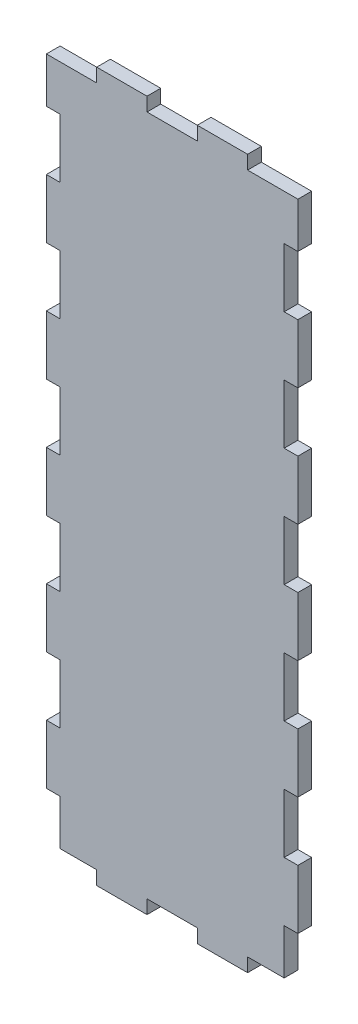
ISO-10303-21;
HEADER;
FILE_DESCRIPTION(('STEP AP214'),'2;1');
FILE_NAME('part.step','',(''),(''),'','','');
FILE_SCHEMA(('AUTOMOTIVE_DESIGN { 1 0 10303 214 1 1 1 1 }'));
ENDSEC;
DATA;
#1=APPLICATION_CONTEXT('core data for automotive mechanical design processes');
#2=APPLICATION_PROTOCOL_DEFINITION('international standard','automotive_design',2000,#1);
#3=PRODUCT_CONTEXT('',#1,'mechanical');
#4=PRODUCT('Part','Part','',(#3));
#5=PRODUCT_RELATED_PRODUCT_CATEGORY('part','',(#4));
#6=PRODUCT_DEFINITION_FORMATION('','',#4);
#7=PRODUCT_DEFINITION_CONTEXT('part definition',#1,'design');
#8=PRODUCT_DEFINITION('design','',#6,#7);
#9=PRODUCT_DEFINITION_SHAPE('','',#8);
#10=(LENGTH_UNIT() NAMED_UNIT(*) SI_UNIT(.MILLI.,.METRE.));
#11=(NAMED_UNIT(*) PLANE_ANGLE_UNIT() SI_UNIT($,.RADIAN.));
#12=(NAMED_UNIT(*) SI_UNIT($,.STERADIAN.) SOLID_ANGLE_UNIT());
#13=UNCERTAINTY_MEASURE_WITH_UNIT(LENGTH_MEASURE(1.E-05),#10,'distance_accuracy_value','');
#14=(GEOMETRIC_REPRESENTATION_CONTEXT(3) GLOBAL_UNCERTAINTY_ASSIGNED_CONTEXT((#13)) GLOBAL_UNIT_ASSIGNED_CONTEXT((#10,
#11,#12)) REPRESENTATION_CONTEXT('',''));
#15=CARTESIAN_POINT('',(0.,0.,0.));
#16=DIRECTION('',(0.,0.,1.));
#17=DIRECTION('',(1.,0.,0.));
#18=AXIS2_PLACEMENT_3D('',#15,#16,#17);
#19=CARTESIAN_POINT('',(0.,0.,3.));
#20=DIRECTION('',(0.,0.,1.));
#21=DIRECTION('',(1.,0.,0.));
#22=AXIS2_PLACEMENT_3D('',#19,#20,#21);
#23=PLANE('',#22);
#24=DIRECTION('',(0.,-1.,0.));
#25=VECTOR('',#24,1.);
#26=CARTESIAN_POINT('',(16.5,0.,3.));
#27=LINE('',#26,#25);
#28=CARTESIAN_POINT('',(16.5,77.5,3.));
#29=VERTEX_POINT('',#28);
#30=CARTESIAN_POINT('',(16.5,74.5,3.));
#31=VERTEX_POINT('',#30);
#32=EDGE_CURVE('E444',#29,#31,#27,.T.);
#33=ORIENTED_EDGE('',*,*,#32,.F.);
#34=DIRECTION('',(-1.,0.,0.));
#35=VECTOR('',#34,1.);
#36=CARTESIAN_POINT('',(-27.5,77.5,3.));
#37=LINE('',#36,#35);
#38=CARTESIAN_POINT('',(5.49999999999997,77.5,3.));
#39=VERTEX_POINT('',#38);
#40=EDGE_CURVE('E457',#29,#39,#37,.T.);
#41=ORIENTED_EDGE('',*,*,#40,.T.);
#42=DIRECTION('',(0.,1.,0.));
#43=VECTOR('',#42,1.);
#44=CARTESIAN_POINT('',(5.49999999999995,0.,3.));
#45=LINE('',#44,#43);
#46=CARTESIAN_POINT('',(5.49999999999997,74.5,3.));
#47=VERTEX_POINT('',#46);
#48=EDGE_CURVE('E62',#47,#39,#45,.T.);
#49=ORIENTED_EDGE('',*,*,#48,.F.);
#50=DIRECTION('',(1.,0.,0.));
#51=VECTOR('',#50,1.);
#52=CARTESIAN_POINT('',(0.,74.5,3.));
#53=LINE('',#52,#51);
#54=CARTESIAN_POINT('',(-5.50000000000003,74.5,3.));
#55=VERTEX_POINT('',#54);
#56=EDGE_CURVE('E453',#55,#47,#53,.T.);
#57=ORIENTED_EDGE('',*,*,#56,.F.);
#58=DIRECTION('',(0.,-1.,0.));
#59=VECTOR('',#58,1.);
#60=CARTESIAN_POINT('',(-5.50000000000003,0.,3.));
#61=LINE('',#60,#59);
#62=CARTESIAN_POINT('',(-5.50000000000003,77.5,3.));
#63=VERTEX_POINT('',#62);
#64=EDGE_CURVE('E518',#63,#55,#61,.T.);
#65=ORIENTED_EDGE('',*,*,#64,.F.);
#66=CARTESIAN_POINT('',(-16.5,77.5,3.));
#67=VERTEX_POINT('',#66);
#68=EDGE_CURVE('E465',#63,#67,#37,.T.);
#69=ORIENTED_EDGE('',*,*,#68,.T.);
#70=DIRECTION('',(0.,1.,0.));
#71=VECTOR('',#70,1.);
#72=CARTESIAN_POINT('',(-16.5,0.,3.));
#73=LINE('',#72,#71);
#74=CARTESIAN_POINT('',(-16.5,74.5,3.));
#75=VERTEX_POINT('',#74);
#76=EDGE_CURVE('E589',#75,#67,#73,.T.);
#77=ORIENTED_EDGE('',*,*,#76,.F.);
#78=DIRECTION('',(1.,0.,0.));
#79=VECTOR('',#78,1.);
#80=CARTESIAN_POINT('',(0.,74.5,3.));
#81=LINE('',#80,#79);
#82=CARTESIAN_POINT('',(-27.5,74.5,3.));
#83=VERTEX_POINT('',#82);
#84=EDGE_CURVE('E460',#83,#75,#81,.T.);
#85=ORIENTED_EDGE('',*,*,#84,.F.);
#86=DIRECTION('',(0.,-1.,0.));
#87=VECTOR('',#86,1.);
#88=CARTESIAN_POINT('',(-27.5,77.5,3.));
#89=LINE('',#88,#87);
#90=CARTESIAN_POINT('',(-27.5,64.5833333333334,3.));
#91=VERTEX_POINT('',#90);
#92=EDGE_CURVE('E470',#83,#91,#89,.T.);
#93=ORIENTED_EDGE('',*,*,#92,.T.);
#94=DIRECTION('',(1.,0.,0.));
#95=VECTOR('',#94,1.);
#96=CARTESIAN_POINT('',(0.,64.5833333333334,3.));
#97=LINE('',#96,#95);
#98=CARTESIAN_POINT('',(-24.5,64.5833333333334,3.));
#99=VERTEX_POINT('',#98);
#100=EDGE_CURVE('E868',#91,#99,#97,.T.);
#101=ORIENTED_EDGE('',*,*,#100,.T.);
#102=DIRECTION('',(0.,-1.,0.));
#103=VECTOR('',#102,1.);
#104=CARTESIAN_POINT('',(-24.5,0.,3.));
#105=LINE('',#104,#103);
#106=CARTESIAN_POINT('',(-24.5,51.6666666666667,3.));
#107=VERTEX_POINT('',#106);
#108=EDGE_CURVE('E876',#99,#107,#105,.T.);
#109=ORIENTED_EDGE('',*,*,#108,.T.);
#110=DIRECTION('',(-1.,0.,0.));
#111=VECTOR('',#110,1.);
#112=CARTESIAN_POINT('',(0.,51.6666666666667,3.));
#113=LINE('',#112,#111);
#114=CARTESIAN_POINT('',(-27.5,51.6666666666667,3.));
#115=VERTEX_POINT('',#114);
#116=EDGE_CURVE('E625',#107,#115,#113,.T.);
#117=ORIENTED_EDGE('',*,*,#116,.T.);
#118=CARTESIAN_POINT('',(-27.5,38.75,3.));
#119=VERTEX_POINT('',#118);
#120=EDGE_CURVE('E475',#115,#119,#89,.T.);
#121=ORIENTED_EDGE('',*,*,#120,.T.);
#122=DIRECTION('',(1.,0.,0.));
#123=VECTOR('',#122,1.);
#124=CARTESIAN_POINT('',(0.,38.75,3.));
#125=LINE('',#124,#123);
#126=CARTESIAN_POINT('',(-24.5,38.75,3.));
#127=VERTEX_POINT('',#126);
#128=EDGE_CURVE('E615',#119,#127,#125,.T.);
#129=ORIENTED_EDGE('',*,*,#128,.T.);
#130=DIRECTION('',(0.,-1.,0.));
#131=VECTOR('',#130,1.);
#132=CARTESIAN_POINT('',(-24.5,0.,3.));
#133=LINE('',#132,#131);
#134=CARTESIAN_POINT('',(-24.5,25.8333333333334,3.));
#135=VERTEX_POINT('',#134);
#136=EDGE_CURVE('E618',#127,#135,#133,.T.);
#137=ORIENTED_EDGE('',*,*,#136,.T.);
#138=DIRECTION('',(-1.,0.,0.));
#139=VECTOR('',#138,1.);
#140=CARTESIAN_POINT('',(0.,25.8333333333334,3.));
#141=LINE('',#140,#139);
#142=CARTESIAN_POINT('',(-27.5,25.8333333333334,3.));
#143=VERTEX_POINT('',#142);
#144=EDGE_CURVE('E622',#135,#143,#141,.T.);
#145=ORIENTED_EDGE('',*,*,#144,.T.);
#146=CARTESIAN_POINT('',(-27.5,12.9166666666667,3.));
#147=VERTEX_POINT('',#146);
#148=EDGE_CURVE('E909',#143,#147,#89,.T.);
#149=ORIENTED_EDGE('',*,*,#148,.T.);
#150=DIRECTION('',(1.,0.,0.));
#151=VECTOR('',#150,1.);
#152=CARTESIAN_POINT('',(0.,12.9166666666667,3.));
#153=LINE('',#152,#151);
#154=CARTESIAN_POINT('',(-24.5,12.9166666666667,3.));
#155=VERTEX_POINT('',#154);
#156=EDGE_CURVE('E642',#147,#155,#153,.T.);
#157=ORIENTED_EDGE('',*,*,#156,.T.);
#158=DIRECTION('',(0.,-1.,0.));
#159=VECTOR('',#158,1.);
#160=CARTESIAN_POINT('',(-24.5,0.,3.));
#161=LINE('',#160,#159);
#162=CARTESIAN_POINT('',(-24.5,0.,3.));
#163=VERTEX_POINT('',#162);
#164=EDGE_CURVE('E645',#155,#163,#161,.T.);
#165=ORIENTED_EDGE('',*,*,#164,.T.);
#166=DIRECTION('',(-1.,0.,0.));
#167=VECTOR('',#166,1.);
#168=CARTESIAN_POINT('',(0.,0.,3.));
#169=LINE('',#168,#167);
#170=CARTESIAN_POINT('',(-27.5,0.,3.));
#171=VERTEX_POINT('',#170);
#172=EDGE_CURVE('E614',#163,#171,#169,.T.);
#173=ORIENTED_EDGE('',*,*,#172,.T.);
#174=CARTESIAN_POINT('',(-27.5,-12.9166666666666,3.));
#175=VERTEX_POINT('',#174);
#176=EDGE_CURVE('E911',#171,#175,#89,.T.);
#177=ORIENTED_EDGE('',*,*,#176,.T.);
#178=DIRECTION('',(1.,0.,0.));
#179=VECTOR('',#178,1.);
#180=CARTESIAN_POINT('',(0.,-12.9166666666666,3.));
#181=LINE('',#180,#179);
#182=CARTESIAN_POINT('',(-24.5,-12.9166666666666,3.));
#183=VERTEX_POINT('',#182);
#184=EDGE_CURVE('E667',#175,#183,#181,.T.);
#185=ORIENTED_EDGE('',*,*,#184,.T.);
#186=DIRECTION('',(0.,-1.,0.));
#187=VECTOR('',#186,1.);
#188=CARTESIAN_POINT('',(-24.5,0.,3.));
#189=LINE('',#188,#187);
#190=CARTESIAN_POINT('',(-24.5,-25.8333333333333,3.));
#191=VERTEX_POINT('',#190);
#192=EDGE_CURVE('E670',#183,#191,#189,.T.);
#193=ORIENTED_EDGE('',*,*,#192,.T.);
#194=DIRECTION('',(-1.,0.,0.));
#195=VECTOR('',#194,1.);
#196=CARTESIAN_POINT('',(0.,-25.8333333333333,3.));
#197=LINE('',#196,#195);
#198=CARTESIAN_POINT('',(-27.5,-25.8333333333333,3.));
#199=VERTEX_POINT('',#198);
#200=EDGE_CURVE('E641',#191,#199,#197,.T.);
#201=ORIENTED_EDGE('',*,*,#200,.T.);
#202=CARTESIAN_POINT('',(-27.5,-38.75,3.));
#203=VERTEX_POINT('',#202);
#204=EDGE_CURVE('E468',#199,#203,#89,.T.);
#205=ORIENTED_EDGE('',*,*,#204,.T.);
#206=DIRECTION('',(1.,0.,0.));
#207=VECTOR('',#206,1.);
#208=CARTESIAN_POINT('',(0.,-38.75,3.));
#209=LINE('',#208,#207);
#210=CARTESIAN_POINT('',(-24.5,-38.75,3.));
#211=VERTEX_POINT('',#210);
#212=EDGE_CURVE('E692',#203,#211,#209,.T.);
#213=ORIENTED_EDGE('',*,*,#212,.T.);
#214=DIRECTION('',(0.,-1.,0.));
#215=VECTOR('',#214,1.);
#216=CARTESIAN_POINT('',(-24.5,0.,3.));
#217=LINE('',#216,#215);
#218=CARTESIAN_POINT('',(-24.5,-51.6666666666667,3.));
#219=VERTEX_POINT('',#218);
#220=EDGE_CURVE('E695',#211,#219,#217,.T.);
#221=ORIENTED_EDGE('',*,*,#220,.T.);
#222=DIRECTION('',(-1.,0.,0.));
#223=VECTOR('',#222,1.);
#224=CARTESIAN_POINT('',(0.,-51.6666666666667,3.));
#225=LINE('',#224,#223);
#226=CARTESIAN_POINT('',(-27.5,-51.6666666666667,3.));
#227=VERTEX_POINT('',#226);
#228=EDGE_CURVE('E666',#219,#227,#225,.T.);
#229=ORIENTED_EDGE('',*,*,#228,.T.);
#230=CARTESIAN_POINT('',(-27.5,-64.5833333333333,3.));
#231=VERTEX_POINT('',#230);
#232=EDGE_CURVE('E464',#227,#231,#89,.T.);
#233=ORIENTED_EDGE('',*,*,#232,.T.);
#234=DIRECTION('',(1.,0.,0.));
#235=VECTOR('',#234,1.);
#236=CARTESIAN_POINT('',(0.,-64.5833333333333,3.));
#237=LINE('',#236,#235);
#238=CARTESIAN_POINT('',(-24.5,-64.5833333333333,3.));
#239=VERTEX_POINT('',#238);
#240=EDGE_CURVE('E712',#231,#239,#237,.T.);
#241=ORIENTED_EDGE('',*,*,#240,.T.);
#242=DIRECTION('',(0.,-1.,0.));
#243=VECTOR('',#242,1.);
#244=CARTESIAN_POINT('',(-24.5,0.,3.));
#245=LINE('',#244,#243);
#246=CARTESIAN_POINT('',(-24.5,-74.5,3.));
#247=VERTEX_POINT('',#246);
#248=EDGE_CURVE('E691',#239,#247,#245,.T.);
#249=ORIENTED_EDGE('',*,*,#248,.T.);
#250=DIRECTION('',(1.,0.,0.));
#251=VECTOR('',#250,1.);
#252=CARTESIAN_POINT('',(0.,-74.5,3.));
#253=LINE('',#252,#251);
#254=CARTESIAN_POINT('',(-16.5,-74.5,3.));
#255=VERTEX_POINT('',#254);
#256=EDGE_CURVE('E555',#247,#255,#253,.T.);
#257=ORIENTED_EDGE('',*,*,#256,.T.);
#258=DIRECTION('',(0.,-1.,0.));
#259=VECTOR('',#258,1.);
#260=CARTESIAN_POINT('',(-16.5,0.,3.));
#261=LINE('',#260,#259);
#262=CARTESIAN_POINT('',(-16.5,-77.5,3.));
#263=VERTEX_POINT('',#262);
#264=EDGE_CURVE('E577',#255,#263,#261,.T.);
#265=ORIENTED_EDGE('',*,*,#264,.T.);
#266=DIRECTION('',(1.,0.,0.));
#267=VECTOR('',#266,1.);
#268=CARTESIAN_POINT('',(-27.5,-77.5,3.));
#269=LINE('',#268,#267);
#270=CARTESIAN_POINT('',(-5.50000000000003,-77.5,3.));
#271=VERTEX_POINT('',#270);
#272=EDGE_CURVE('E12',#263,#271,#269,.T.);
#273=ORIENTED_EDGE('',*,*,#272,.T.);
#274=DIRECTION('',(0.,1.,0.));
#275=VECTOR('',#274,1.);
#276=CARTESIAN_POINT('',(-5.50000000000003,0.,3.));
#277=LINE('',#276,#275);
#278=CARTESIAN_POINT('',(-5.50000000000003,-74.5,3.));
#279=VERTEX_POINT('',#278);
#280=EDGE_CURVE('E533',#271,#279,#277,.T.);
#281=ORIENTED_EDGE('',*,*,#280,.T.);
#282=DIRECTION('',(1.,0.,0.));
#283=VECTOR('',#282,1.);
#284=CARTESIAN_POINT('',(0.,-74.5,3.));
#285=LINE('',#284,#283);
#286=CARTESIAN_POINT('',(5.49999999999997,-74.5,3.));
#287=VERTEX_POINT('',#286);
#288=EDGE_CURVE('E556',#279,#287,#285,.T.);
#289=ORIENTED_EDGE('',*,*,#288,.T.);
#290=DIRECTION('',(0.,-1.,0.));
#291=VECTOR('',#290,1.);
#292=CARTESIAN_POINT('',(5.49999999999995,0.,3.));
#293=LINE('',#292,#291);
#294=CARTESIAN_POINT('',(5.49999999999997,-77.5,3.));
#295=VERTEX_POINT('',#294);
#296=EDGE_CURVE('E559',#287,#295,#293,.T.);
#297=ORIENTED_EDGE('',*,*,#296,.T.);
#298=CARTESIAN_POINT('',(16.5,-77.5,3.));
#299=VERTEX_POINT('',#298);
#300=EDGE_CURVE('E46',#295,#299,#269,.T.);
#301=ORIENTED_EDGE('',*,*,#300,.T.);
#302=DIRECTION('',(0.,1.,0.));
#303=VECTOR('',#302,1.);
#304=CARTESIAN_POINT('',(16.5,0.,3.));
#305=LINE('',#304,#303);
#306=CARTESIAN_POINT('',(16.5,-74.5,3.));
#307=VERTEX_POINT('',#306);
#308=EDGE_CURVE('E537',#299,#307,#305,.T.);
#309=ORIENTED_EDGE('',*,*,#308,.T.);
#310=DIRECTION('',(1.,0.,0.));
#311=VECTOR('',#310,1.);
#312=CARTESIAN_POINT('',(0.,-74.5,3.));
#313=LINE('',#312,#311);
#314=CARTESIAN_POINT('',(24.5000000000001,-74.5,3.));
#315=VERTEX_POINT('',#314);
#316=EDGE_CURVE('E534',#307,#315,#313,.T.);
#317=ORIENTED_EDGE('',*,*,#316,.T.);
#318=DIRECTION('',(0.,-1.,0.));
#319=VECTOR('',#318,1.);
#320=CARTESIAN_POINT('',(24.5000000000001,0.,3.));
#321=LINE('',#320,#319);
#322=CARTESIAN_POINT('',(24.5000000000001,-64.5833333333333,3.));
#323=VERTEX_POINT('',#322);
#324=EDGE_CURVE('E727',#323,#315,#321,.T.);
#325=ORIENTED_EDGE('',*,*,#324,.F.);
#326=DIRECTION('',(-1.,0.,0.));
#327=VECTOR('',#326,1.);
#328=CARTESIAN_POINT('',(0.,-64.5833333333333,3.));
#329=LINE('',#328,#327);
#330=CARTESIAN_POINT('',(27.5,-64.5833333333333,3.));
#331=VERTEX_POINT('',#330);
#332=EDGE_CURVE('E711',#331,#323,#329,.T.);
#333=ORIENTED_EDGE('',*,*,#332,.F.);
#334=DIRECTION('',(0.,1.,0.));
#335=VECTOR('',#334,1.);
#336=CARTESIAN_POINT('',(27.5,77.5,3.));
#337=LINE('',#336,#335);
#338=CARTESIAN_POINT('',(27.5,-51.6666666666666,3.));
#339=VERTEX_POINT('',#338);
#340=EDGE_CURVE('E471',#331,#339,#337,.T.);
#341=ORIENTED_EDGE('',*,*,#340,.T.);
#342=DIRECTION('',(1.,0.,0.));
#343=VECTOR('',#342,1.);
#344=CARTESIAN_POINT('',(0.,-51.6666666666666,3.));
#345=LINE('',#344,#343);
#346=CARTESIAN_POINT('',(24.5000000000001,-51.6666666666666,3.));
#347=VERTEX_POINT('',#346);
#348=EDGE_CURVE('E748',#347,#339,#345,.T.);
#349=ORIENTED_EDGE('',*,*,#348,.F.);
#350=DIRECTION('',(0.,-1.,0.));
#351=VECTOR('',#350,1.);
#352=CARTESIAN_POINT('',(24.5,0.,3.));
#353=LINE('',#352,#351);
#354=CARTESIAN_POINT('',(24.5000000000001,-38.75,3.));
#355=VERTEX_POINT('',#354);
#356=EDGE_CURVE('E750',#355,#347,#353,.T.);
#357=ORIENTED_EDGE('',*,*,#356,.F.);
#358=DIRECTION('',(-1.,0.,0.));
#359=VECTOR('',#358,1.);
#360=CARTESIAN_POINT('',(0.,-38.75,3.));
#361=LINE('',#360,#359);
#362=CARTESIAN_POINT('',(27.5,-38.75,3.));
#363=VERTEX_POINT('',#362);
#364=EDGE_CURVE('E726',#363,#355,#361,.T.);
#365=ORIENTED_EDGE('',*,*,#364,.F.);
#366=CARTESIAN_POINT('',(27.5,-25.8333333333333,3.));
#367=VERTEX_POINT('',#366);
#368=EDGE_CURVE('E965',#363,#367,#337,.T.);
#369=ORIENTED_EDGE('',*,*,#368,.T.);
#370=DIRECTION('',(1.,0.,0.));
#371=VECTOR('',#370,1.);
#372=CARTESIAN_POINT('',(0.,-25.8333333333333,3.));
#373=LINE('',#372,#371);
#374=CARTESIAN_POINT('',(24.5,-25.8333333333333,3.));
#375=VERTEX_POINT('',#374);
#376=EDGE_CURVE('E774',#375,#367,#373,.T.);
#377=ORIENTED_EDGE('',*,*,#376,.F.);
#378=DIRECTION('',(0.,-1.,0.));
#379=VECTOR('',#378,1.);
#380=CARTESIAN_POINT('',(24.5,0.,3.));
#381=LINE('',#380,#379);
#382=CARTESIAN_POINT('',(24.5,-12.9166666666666,3.));
#383=VERTEX_POINT('',#382);
#384=EDGE_CURVE('E776',#383,#375,#381,.T.);
#385=ORIENTED_EDGE('',*,*,#384,.F.);
#386=DIRECTION('',(-1.,0.,0.));
#387=VECTOR('',#386,1.);
#388=CARTESIAN_POINT('',(0.,-12.9166666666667,3.));
#389=LINE('',#388,#387);
#390=CARTESIAN_POINT('',(27.5,-12.9166666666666,3.));
#391=VERTEX_POINT('',#390);
#392=EDGE_CURVE('E747',#391,#383,#389,.T.);
#393=ORIENTED_EDGE('',*,*,#392,.F.);
#394=CARTESIAN_POINT('',(27.5,0.,3.));
#395=VERTEX_POINT('',#394);
#396=EDGE_CURVE('E970',#391,#395,#337,.T.);
#397=ORIENTED_EDGE('',*,*,#396,.T.);
#398=DIRECTION('',(1.,0.,0.));
#399=VECTOR('',#398,1.);
#400=CARTESIAN_POINT('',(0.,0.,3.));
#401=LINE('',#400,#399);
#402=CARTESIAN_POINT('',(24.5,0.,3.));
#403=VERTEX_POINT('',#402);
#404=EDGE_CURVE('E800',#403,#395,#401,.T.);
#405=ORIENTED_EDGE('',*,*,#404,.F.);
#406=DIRECTION('',(0.,-1.,0.));
#407=VECTOR('',#406,1.);
#408=CARTESIAN_POINT('',(24.5,0.,3.));
#409=LINE('',#408,#407);
#410=CARTESIAN_POINT('',(24.5,12.9166666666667,3.));
#411=VERTEX_POINT('',#410);
#412=EDGE_CURVE('E802',#411,#403,#409,.T.);
#413=ORIENTED_EDGE('',*,*,#412,.F.);
#414=DIRECTION('',(-1.,0.,0.));
#415=VECTOR('',#414,1.);
#416=CARTESIAN_POINT('',(0.,12.9166666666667,3.));
#417=LINE('',#416,#415);
#418=CARTESIAN_POINT('',(27.5,12.9166666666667,3.));
#419=VERTEX_POINT('',#418);
#420=EDGE_CURVE('E773',#419,#411,#417,.T.);
#421=ORIENTED_EDGE('',*,*,#420,.F.);
#422=CARTESIAN_POINT('',(27.5,25.8333333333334,3.));
#423=VERTEX_POINT('',#422);
#424=EDGE_CURVE('E963',#419,#423,#337,.T.);
#425=ORIENTED_EDGE('',*,*,#424,.T.);
#426=DIRECTION('',(1.,0.,0.));
#427=VECTOR('',#426,1.);
#428=CARTESIAN_POINT('',(0.,25.8333333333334,3.));
#429=LINE('',#428,#427);
#430=CARTESIAN_POINT('',(24.5,25.8333333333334,3.));
#431=VERTEX_POINT('',#430);
#432=EDGE_CURVE('E826',#431,#423,#429,.T.);
#433=ORIENTED_EDGE('',*,*,#432,.F.);
#434=DIRECTION('',(0.,-1.,0.));
#435=VECTOR('',#434,1.);
#436=CARTESIAN_POINT('',(24.5000000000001,0.,3.));
#437=LINE('',#436,#435);
#438=CARTESIAN_POINT('',(24.5,38.75,3.));
#439=VERTEX_POINT('',#438);
#440=EDGE_CURVE('E828',#439,#431,#437,.T.);
#441=ORIENTED_EDGE('',*,*,#440,.F.);
#442=DIRECTION('',(-1.,0.,0.));
#443=VECTOR('',#442,1.);
#444=CARTESIAN_POINT('',(0.,38.75,3.));
#445=LINE('',#444,#443);
#446=CARTESIAN_POINT('',(27.5,38.75,3.));
#447=VERTEX_POINT('',#446);
#448=EDGE_CURVE('E799',#447,#439,#445,.T.);
#449=ORIENTED_EDGE('',*,*,#448,.F.);
#450=CARTESIAN_POINT('',(27.5,51.6666666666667,3.));
#451=VERTEX_POINT('',#450);
#452=EDGE_CURVE('E959',#447,#451,#337,.T.);
#453=ORIENTED_EDGE('',*,*,#452,.T.);
#454=DIRECTION('',(1.,0.,0.));
#455=VECTOR('',#454,1.);
#456=CARTESIAN_POINT('',(0.,51.6666666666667,3.));
#457=LINE('',#456,#455);
#458=CARTESIAN_POINT('',(24.5,51.6666666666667,3.));
#459=VERTEX_POINT('',#458);
#460=EDGE_CURVE('E850',#459,#451,#457,.T.);
#461=ORIENTED_EDGE('',*,*,#460,.F.);
#462=DIRECTION('',(0.,-1.,0.));
#463=VECTOR('',#462,1.);
#464=CARTESIAN_POINT('',(24.5000000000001,0.,3.));
#465=LINE('',#464,#463);
#466=CARTESIAN_POINT('',(24.5,64.5833333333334,3.));
#467=VERTEX_POINT('',#466);
#468=EDGE_CURVE('E852',#467,#459,#465,.T.);
#469=ORIENTED_EDGE('',*,*,#468,.F.);
#470=DIRECTION('',(-1.,0.,0.));
#471=VECTOR('',#470,1.);
#472=CARTESIAN_POINT('',(0.,64.5833333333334,3.));
#473=LINE('',#472,#471);
#474=CARTESIAN_POINT('',(27.5,64.5833333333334,3.));
#475=VERTEX_POINT('',#474);
#476=EDGE_CURVE('E825',#475,#467,#473,.T.);
#477=ORIENTED_EDGE('',*,*,#476,.F.);
#478=CARTESIAN_POINT('',(27.5,74.5,3.));
#479=VERTEX_POINT('',#478);
#480=EDGE_CURVE('E473',#475,#479,#337,.T.);
#481=ORIENTED_EDGE('',*,*,#480,.T.);
#482=DIRECTION('',(1.,0.,0.));
#483=VECTOR('',#482,1.);
#484=CARTESIAN_POINT('',(0.,74.5,3.));
#485=LINE('',#484,#483);
#486=EDGE_CURVE('E459',#31,#479,#485,.T.);
#487=ORIENTED_EDGE('',*,*,#486,.F.);
#488=EDGE_LOOP('',(#33,#41,#49,#57,#65,#69,#77,#85,#93,#101,#109,#117,#121,#129,#137,#145,#149,
#157,#165,#173,#177,#185,#193,#201,#205,#213,#221,#229,#233,#241,#249,#257,#265,#273,#281,#289,
#297,#301,#309,#317,#325,#333,#341,#349,#357,#365,#369,#377,#385,#393,#397,#405,#413,#421,#425,
#433,#441,#449,#453,#461,#469,#477,#481,#487));
#489=FACE_BOUND('',#488,.T.);
#490=ADVANCED_FACE('F37',(#489),#23,.T.);
#491=CARTESIAN_POINT('',(0.,0.,0.));
#492=DIRECTION('',(0.,0.,1.));
#493=DIRECTION('',(1.,0.,0.));
#494=AXIS2_PLACEMENT_3D('',#491,#492,#493);
#495=PLANE('',#494);
#496=DIRECTION('',(-1.,0.,0.));
#497=VECTOR('',#496,1.);
#498=CARTESIAN_POINT('',(-27.5,77.5,0.));
#499=LINE('',#498,#497);
#500=CARTESIAN_POINT('',(16.5,77.5,0.));
#501=VERTEX_POINT('',#500);
#502=CARTESIAN_POINT('',(5.49999999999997,77.5,0.));
#503=VERTEX_POINT('',#502);
#504=EDGE_CURVE('E485',#501,#503,#499,.T.);
#505=ORIENTED_EDGE('',*,*,#504,.F.);
#506=DIRECTION('',(0.,-1.,0.));
#507=VECTOR('',#506,1.);
#508=CARTESIAN_POINT('',(16.5,0.,0.));
#509=LINE('',#508,#507);
#510=CARTESIAN_POINT('',(16.5,74.5,0.));
#511=VERTEX_POINT('',#510);
#512=EDGE_CURVE('E447',#501,#511,#509,.T.);
#513=ORIENTED_EDGE('',*,*,#512,.T.);
#514=DIRECTION('',(1.,0.,0.));
#515=VECTOR('',#514,1.);
#516=CARTESIAN_POINT('',(0.,74.5,0.));
#517=LINE('',#516,#515);
#518=CARTESIAN_POINT('',(27.5,74.5,0.));
#519=VERTEX_POINT('',#518);
#520=EDGE_CURVE('E1021',#511,#519,#517,.T.);
#521=ORIENTED_EDGE('',*,*,#520,.T.);
#522=DIRECTION('',(0.,1.,0.));
#523=VECTOR('',#522,1.);
#524=CARTESIAN_POINT('',(27.5,77.5,0.));
#525=LINE('',#524,#523);
#526=CARTESIAN_POINT('',(27.5,64.5833333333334,0.));
#527=VERTEX_POINT('',#526);
#528=EDGE_CURVE('E478',#527,#519,#525,.T.);
#529=ORIENTED_EDGE('',*,*,#528,.F.);
#530=DIRECTION('',(-1.,0.,0.));
#531=VECTOR('',#530,1.);
#532=CARTESIAN_POINT('',(0.,64.5833333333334,0.));
#533=LINE('',#532,#531);
#534=CARTESIAN_POINT('',(24.5,64.5833333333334,0.));
#535=VERTEX_POINT('',#534);
#536=EDGE_CURVE('E853',#527,#535,#533,.T.);
#537=ORIENTED_EDGE('',*,*,#536,.T.);
#538=DIRECTION('',(0.,-1.,0.));
#539=VECTOR('',#538,1.);
#540=CARTESIAN_POINT('',(24.5000000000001,0.,0.));
#541=LINE('',#540,#539);
#542=CARTESIAN_POINT('',(24.5,51.6666666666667,0.));
#543=VERTEX_POINT('',#542);
#544=EDGE_CURVE('E860',#535,#543,#541,.T.);
#545=ORIENTED_EDGE('',*,*,#544,.T.);
#546=DIRECTION('',(1.,0.,0.));
#547=VECTOR('',#546,1.);
#548=CARTESIAN_POINT('',(0.,51.6666666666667,0.));
#549=LINE('',#548,#547);
#550=CARTESIAN_POINT('',(27.5,51.6666666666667,0.));
#551=VERTEX_POINT('',#550);
#552=EDGE_CURVE('E843',#543,#551,#549,.T.);
#553=ORIENTED_EDGE('',*,*,#552,.T.);
#554=CARTESIAN_POINT('',(27.5,38.75,0.));
#555=VERTEX_POINT('',#554);
#556=EDGE_CURVE('E481',#555,#551,#525,.T.);
#557=ORIENTED_EDGE('',*,*,#556,.F.);
#558=DIRECTION('',(-1.,0.,0.));
#559=VECTOR('',#558,1.);
#560=CARTESIAN_POINT('',(0.,38.75,0.));
#561=LINE('',#560,#559);
#562=CARTESIAN_POINT('',(24.5,38.75,0.));
#563=VERTEX_POINT('',#562);
#564=EDGE_CURVE('E829',#555,#563,#561,.T.);
#565=ORIENTED_EDGE('',*,*,#564,.T.);
#566=DIRECTION('',(0.,-1.,0.));
#567=VECTOR('',#566,1.);
#568=CARTESIAN_POINT('',(24.5000000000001,0.,0.));
#569=LINE('',#568,#567);
#570=CARTESIAN_POINT('',(24.5,25.8333333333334,0.));
#571=VERTEX_POINT('',#570);
#572=EDGE_CURVE('E836',#563,#571,#569,.T.);
#573=ORIENTED_EDGE('',*,*,#572,.T.);
#574=DIRECTION('',(1.,0.,0.));
#575=VECTOR('',#574,1.);
#576=CARTESIAN_POINT('',(0.,25.8333333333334,0.));
#577=LINE('',#576,#575);
#578=CARTESIAN_POINT('',(27.5,25.8333333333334,0.));
#579=VERTEX_POINT('',#578);
#580=EDGE_CURVE('E817',#571,#579,#577,.T.);
#581=ORIENTED_EDGE('',*,*,#580,.T.);
#582=CARTESIAN_POINT('',(27.5,12.9166666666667,0.));
#583=VERTEX_POINT('',#582);
#584=EDGE_CURVE('E989',#583,#579,#525,.T.);
#585=ORIENTED_EDGE('',*,*,#584,.F.);
#586=DIRECTION('',(-1.,0.,0.));
#587=VECTOR('',#586,1.);
#588=CARTESIAN_POINT('',(0.,12.9166666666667,0.));
#589=LINE('',#588,#587);
#590=CARTESIAN_POINT('',(24.5,12.9166666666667,0.));
#591=VERTEX_POINT('',#590);
#592=EDGE_CURVE('E803',#583,#591,#589,.T.);
#593=ORIENTED_EDGE('',*,*,#592,.T.);
#594=DIRECTION('',(0.,-1.,0.));
#595=VECTOR('',#594,1.);
#596=CARTESIAN_POINT('',(24.5,0.,0.));
#597=LINE('',#596,#595);
#598=CARTESIAN_POINT('',(24.5,0.,0.));
#599=VERTEX_POINT('',#598);
#600=EDGE_CURVE('E810',#591,#599,#597,.T.);
#601=ORIENTED_EDGE('',*,*,#600,.T.);
#602=DIRECTION('',(1.,0.,0.));
#603=VECTOR('',#602,1.);
#604=CARTESIAN_POINT('',(0.,0.,0.));
#605=LINE('',#604,#603);
#606=CARTESIAN_POINT('',(27.5,0.,0.));
#607=VERTEX_POINT('',#606);
#608=EDGE_CURVE('E791',#599,#607,#605,.T.);
#609=ORIENTED_EDGE('',*,*,#608,.T.);
#610=CARTESIAN_POINT('',(27.5,-12.9166666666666,0.));
#611=VERTEX_POINT('',#610);
#612=EDGE_CURVE('E1145',#611,#607,#525,.T.);
#613=ORIENTED_EDGE('',*,*,#612,.F.);
#614=DIRECTION('',(-1.,0.,0.));
#615=VECTOR('',#614,1.);
#616=CARTESIAN_POINT('',(0.,-12.9166666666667,0.));
#617=LINE('',#616,#615);
#618=CARTESIAN_POINT('',(24.5,-12.9166666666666,0.));
#619=VERTEX_POINT('',#618);
#620=EDGE_CURVE('E777',#611,#619,#617,.T.);
#621=ORIENTED_EDGE('',*,*,#620,.T.);
#622=DIRECTION('',(0.,-1.,0.));
#623=VECTOR('',#622,1.);
#624=CARTESIAN_POINT('',(24.5,0.,0.));
#625=LINE('',#624,#623);
#626=CARTESIAN_POINT('',(24.5,-25.8333333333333,0.));
#627=VERTEX_POINT('',#626);
#628=EDGE_CURVE('E784',#619,#627,#625,.T.);
#629=ORIENTED_EDGE('',*,*,#628,.T.);
#630=DIRECTION('',(1.,0.,0.));
#631=VECTOR('',#630,1.);
#632=CARTESIAN_POINT('',(0.,-25.8333333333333,0.));
#633=LINE('',#632,#631);
#634=CARTESIAN_POINT('',(27.5,-25.8333333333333,0.));
#635=VERTEX_POINT('',#634);
#636=EDGE_CURVE('E765',#627,#635,#633,.T.);
#637=ORIENTED_EDGE('',*,*,#636,.T.);
#638=CARTESIAN_POINT('',(27.5,-38.75,0.));
#639=VERTEX_POINT('',#638);
#640=EDGE_CURVE('E1131',#639,#635,#525,.T.);
#641=ORIENTED_EDGE('',*,*,#640,.F.);
#642=DIRECTION('',(-1.,0.,0.));
#643=VECTOR('',#642,1.);
#644=CARTESIAN_POINT('',(0.,-38.75,0.));
#645=LINE('',#644,#643);
#646=CARTESIAN_POINT('',(24.5000000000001,-38.75,0.));
#647=VERTEX_POINT('',#646);
#648=EDGE_CURVE('E751',#639,#647,#645,.T.);
#649=ORIENTED_EDGE('',*,*,#648,.T.);
#650=DIRECTION('',(0.,-1.,0.));
#651=VECTOR('',#650,1.);
#652=CARTESIAN_POINT('',(24.5,0.,0.));
#653=LINE('',#652,#651);
#654=CARTESIAN_POINT('',(24.5000000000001,-51.6666666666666,0.));
#655=VERTEX_POINT('',#654);
#656=EDGE_CURVE('E758',#647,#655,#653,.T.);
#657=ORIENTED_EDGE('',*,*,#656,.T.);
#658=DIRECTION('',(1.,0.,0.));
#659=VECTOR('',#658,1.);
#660=CARTESIAN_POINT('',(0.,-51.6666666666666,0.));
#661=LINE('',#660,#659);
#662=CARTESIAN_POINT('',(27.5,-51.6666666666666,0.));
#663=VERTEX_POINT('',#662);
#664=EDGE_CURVE('E739',#655,#663,#661,.T.);
#665=ORIENTED_EDGE('',*,*,#664,.T.);
#666=CARTESIAN_POINT('',(27.5,-64.5833333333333,0.));
#667=VERTEX_POINT('',#666);
#668=EDGE_CURVE('E483',#667,#663,#525,.T.);
#669=ORIENTED_EDGE('',*,*,#668,.F.);
#670=DIRECTION('',(-1.,0.,0.));
#671=VECTOR('',#670,1.);
#672=CARTESIAN_POINT('',(0.,-64.5833333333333,0.));
#673=LINE('',#672,#671);
#674=CARTESIAN_POINT('',(24.5000000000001,-64.5833333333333,0.));
#675=VERTEX_POINT('',#674);
#676=EDGE_CURVE('E730',#667,#675,#673,.T.);
#677=ORIENTED_EDGE('',*,*,#676,.T.);
#678=DIRECTION('',(0.,-1.,0.));
#679=VECTOR('',#678,1.);
#680=CARTESIAN_POINT('',(24.5000000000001,0.,0.));
#681=LINE('',#680,#679);
#682=CARTESIAN_POINT('',(24.5000000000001,-74.5,0.));
#683=VERTEX_POINT('',#682);
#684=EDGE_CURVE('E723',#675,#683,#681,.T.);
#685=ORIENTED_EDGE('',*,*,#684,.T.);
#686=DIRECTION('',(1.,0.,0.));
#687=VECTOR('',#686,1.);
#688=CARTESIAN_POINT('',(0.,-74.5,0.));
#689=LINE('',#688,#687);
#690=CARTESIAN_POINT('',(16.5,-74.5,0.));
#691=VERTEX_POINT('',#690);
#692=EDGE_CURVE('E527',#691,#683,#689,.T.);
#693=ORIENTED_EDGE('',*,*,#692,.F.);
#694=DIRECTION('',(0.,1.,0.));
#695=VECTOR('',#694,1.);
#696=CARTESIAN_POINT('',(16.5,0.,0.));
#697=LINE('',#696,#695);
#698=CARTESIAN_POINT('',(16.5,-77.5,0.));
#699=VERTEX_POINT('',#698);
#700=EDGE_CURVE('E538',#699,#691,#697,.T.);
#701=ORIENTED_EDGE('',*,*,#700,.F.);
#702=DIRECTION('',(1.,0.,0.));
#703=VECTOR('',#702,1.);
#704=CARTESIAN_POINT('',(-27.5,-77.5,0.));
#705=LINE('',#704,#703);
#706=CARTESIAN_POINT('',(5.49999999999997,-77.5,0.));
#707=VERTEX_POINT('',#706);
#708=EDGE_CURVE('E41',#707,#699,#705,.T.);
#709=ORIENTED_EDGE('',*,*,#708,.F.);
#710=DIRECTION('',(0.,-1.,0.));
#711=VECTOR('',#710,1.);
#712=CARTESIAN_POINT('',(5.49999999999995,0.,0.));
#713=LINE('',#712,#711);
#714=CARTESIAN_POINT('',(5.49999999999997,-74.5,0.));
#715=VERTEX_POINT('',#714);
#716=EDGE_CURVE('E54',#715,#707,#713,.T.);
#717=ORIENTED_EDGE('',*,*,#716,.F.);
#718=DIRECTION('',(1.,0.,0.));
#719=VECTOR('',#718,1.);
#720=CARTESIAN_POINT('',(0.,-74.5,0.));
#721=LINE('',#720,#719);
#722=CARTESIAN_POINT('',(-5.50000000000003,-74.5,0.));
#723=VERTEX_POINT('',#722);
#724=EDGE_CURVE('E547',#723,#715,#721,.T.);
#725=ORIENTED_EDGE('',*,*,#724,.F.);
#726=DIRECTION('',(0.,1.,0.));
#727=VECTOR('',#726,1.);
#728=CARTESIAN_POINT('',(-5.50000000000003,0.,0.));
#729=LINE('',#728,#727);
#730=CARTESIAN_POINT('',(-5.50000000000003,-77.5,0.));
#731=VERTEX_POINT('',#730);
#732=EDGE_CURVE('E560',#731,#723,#729,.T.);
#733=ORIENTED_EDGE('',*,*,#732,.F.);
#734=CARTESIAN_POINT('',(-16.5,-77.5,0.));
#735=VERTEX_POINT('',#734);
#736=EDGE_CURVE('E495',#735,#731,#705,.T.);
#737=ORIENTED_EDGE('',*,*,#736,.F.);
#738=DIRECTION('',(0.,-1.,0.));
#739=VECTOR('',#738,1.);
#740=CARTESIAN_POINT('',(-16.5,0.,0.));
#741=LINE('',#740,#739);
#742=CARTESIAN_POINT('',(-16.5,-74.5,0.));
#743=VERTEX_POINT('',#742);
#744=EDGE_CURVE('E571',#743,#735,#741,.T.);
#745=ORIENTED_EDGE('',*,*,#744,.F.);
#746=DIRECTION('',(1.,0.,0.));
#747=VECTOR('',#746,1.);
#748=CARTESIAN_POINT('',(0.,-74.5,0.));
#749=LINE('',#748,#747);
#750=CARTESIAN_POINT('',(-24.5,-74.5,0.));
#751=VERTEX_POINT('',#750);
#752=EDGE_CURVE('E580',#751,#743,#749,.T.);
#753=ORIENTED_EDGE('',*,*,#752,.F.);
#754=DIRECTION('',(0.,-1.,0.));
#755=VECTOR('',#754,1.);
#756=CARTESIAN_POINT('',(-24.5,0.,0.));
#757=LINE('',#756,#755);
#758=CARTESIAN_POINT('',(-24.5,-64.5833333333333,0.));
#759=VERTEX_POINT('',#758);
#760=EDGE_CURVE('E715',#759,#751,#757,.T.);
#761=ORIENTED_EDGE('',*,*,#760,.F.);
#762=DIRECTION('',(1.,0.,0.));
#763=VECTOR('',#762,1.);
#764=CARTESIAN_POINT('',(0.,-64.5833333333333,0.));
#765=LINE('',#764,#763);
#766=CARTESIAN_POINT('',(-27.5,-64.5833333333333,0.));
#767=VERTEX_POINT('',#766);
#768=EDGE_CURVE('E708',#767,#759,#765,.T.);
#769=ORIENTED_EDGE('',*,*,#768,.F.);
#770=DIRECTION('',(0.,-1.,0.));
#771=VECTOR('',#770,1.);
#772=CARTESIAN_POINT('',(-27.5,77.5,0.));
#773=LINE('',#772,#771);
#774=CARTESIAN_POINT('',(-27.5,-51.6666666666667,0.));
#775=VERTEX_POINT('',#774);
#776=EDGE_CURVE('E488',#775,#767,#773,.T.);
#777=ORIENTED_EDGE('',*,*,#776,.F.);
#778=DIRECTION('',(-1.,0.,0.));
#779=VECTOR('',#778,1.);
#780=CARTESIAN_POINT('',(0.,-51.6666666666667,0.));
#781=LINE('',#780,#779);
#782=CARTESIAN_POINT('',(-24.5,-51.6666666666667,0.));
#783=VERTEX_POINT('',#782);
#784=EDGE_CURVE('E696',#783,#775,#781,.T.);
#785=ORIENTED_EDGE('',*,*,#784,.F.);
#786=DIRECTION('',(0.,-1.,0.));
#787=VECTOR('',#786,1.);
#788=CARTESIAN_POINT('',(-24.5,0.,0.));
#789=LINE('',#788,#787);
#790=CARTESIAN_POINT('',(-24.5,-38.75,0.));
#791=VERTEX_POINT('',#790);
#792=EDGE_CURVE('E703',#791,#783,#789,.T.);
#793=ORIENTED_EDGE('',*,*,#792,.F.);
#794=DIRECTION('',(1.,0.,0.));
#795=VECTOR('',#794,1.);
#796=CARTESIAN_POINT('',(0.,-38.75,0.));
#797=LINE('',#796,#795);
#798=CARTESIAN_POINT('',(-27.5,-38.75,0.));
#799=VERTEX_POINT('',#798);
#800=EDGE_CURVE('E683',#799,#791,#797,.T.);
#801=ORIENTED_EDGE('',*,*,#800,.F.);
#802=CARTESIAN_POINT('',(-27.5,-25.8333333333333,0.));
#803=VERTEX_POINT('',#802);
#804=EDGE_CURVE('E499',#803,#799,#773,.T.);
#805=ORIENTED_EDGE('',*,*,#804,.F.);
#806=DIRECTION('',(-1.,0.,0.));
#807=VECTOR('',#806,1.);
#808=CARTESIAN_POINT('',(0.,-25.8333333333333,0.));
#809=LINE('',#808,#807);
#810=CARTESIAN_POINT('',(-24.5,-25.8333333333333,0.));
#811=VERTEX_POINT('',#810);
#812=EDGE_CURVE('E671',#811,#803,#809,.T.);
#813=ORIENTED_EDGE('',*,*,#812,.F.);
#814=DIRECTION('',(0.,-1.,0.));
#815=VECTOR('',#814,1.);
#816=CARTESIAN_POINT('',(-24.5,0.,0.));
#817=LINE('',#816,#815);
#818=CARTESIAN_POINT('',(-24.5,-12.9166666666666,0.));
#819=VERTEX_POINT('',#818);
#820=EDGE_CURVE('E678',#819,#811,#817,.T.);
#821=ORIENTED_EDGE('',*,*,#820,.F.);
#822=DIRECTION('',(1.,0.,0.));
#823=VECTOR('',#822,1.);
#824=CARTESIAN_POINT('',(0.,-12.9166666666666,0.));
#825=LINE('',#824,#823);
#826=CARTESIAN_POINT('',(-27.5,-12.9166666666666,0.));
#827=VERTEX_POINT('',#826);
#828=EDGE_CURVE('E658',#827,#819,#825,.T.);
#829=ORIENTED_EDGE('',*,*,#828,.F.);
#830=CARTESIAN_POINT('',(-27.5,0.,0.));
#831=VERTEX_POINT('',#830);
#832=EDGE_CURVE('E505',#831,#827,#773,.T.);
#833=ORIENTED_EDGE('',*,*,#832,.F.);
#834=DIRECTION('',(-1.,0.,0.));
#835=VECTOR('',#834,1.);
#836=CARTESIAN_POINT('',(0.,0.,0.));
#837=LINE('',#836,#835);
#838=CARTESIAN_POINT('',(-24.5,0.,0.));
#839=VERTEX_POINT('',#838);
#840=EDGE_CURVE('E646',#839,#831,#837,.T.);
#841=ORIENTED_EDGE('',*,*,#840,.F.);
#842=DIRECTION('',(0.,-1.,0.));
#843=VECTOR('',#842,1.);
#844=CARTESIAN_POINT('',(-24.5,0.,0.));
#845=LINE('',#844,#843);
#846=CARTESIAN_POINT('',(-24.5,12.9166666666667,0.));
#847=VERTEX_POINT('',#846);
#848=EDGE_CURVE('E653',#847,#839,#845,.T.);
#849=ORIENTED_EDGE('',*,*,#848,.F.);
#850=DIRECTION('',(1.,0.,0.));
#851=VECTOR('',#850,1.);
#852=CARTESIAN_POINT('',(0.,12.9166666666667,0.));
#853=LINE('',#852,#851);
#854=CARTESIAN_POINT('',(-27.5,12.9166666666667,0.));
#855=VERTEX_POINT('',#854);
#856=EDGE_CURVE('E633',#855,#847,#853,.T.);
#857=ORIENTED_EDGE('',*,*,#856,.F.);
#858=CARTESIAN_POINT('',(-27.5,25.8333333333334,0.));
#859=VERTEX_POINT('',#858);
#860=EDGE_CURVE('E497',#859,#855,#773,.T.);
#861=ORIENTED_EDGE('',*,*,#860,.F.);
#862=DIRECTION('',(-1.,0.,0.));
#863=VECTOR('',#862,1.);
#864=CARTESIAN_POINT('',(0.,25.8333333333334,0.));
#865=LINE('',#864,#863);
#866=CARTESIAN_POINT('',(-24.5,25.8333333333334,0.));
#867=VERTEX_POINT('',#866);
#868=EDGE_CURVE('E619',#867,#859,#865,.T.);
#869=ORIENTED_EDGE('',*,*,#868,.F.);
#870=DIRECTION('',(0.,-1.,0.));
#871=VECTOR('',#870,1.);
#872=CARTESIAN_POINT('',(-24.5,0.,0.));
#873=LINE('',#872,#871);
#874=CARTESIAN_POINT('',(-24.5,38.75,0.));
#875=VERTEX_POINT('',#874);
#876=EDGE_CURVE('E628',#875,#867,#873,.T.);
#877=ORIENTED_EDGE('',*,*,#876,.F.);
#878=DIRECTION('',(1.,0.,0.));
#879=VECTOR('',#878,1.);
#880=CARTESIAN_POINT('',(0.,38.75,0.));
#881=LINE('',#880,#879);
#882=CARTESIAN_POINT('',(-27.5,38.75,0.));
#883=VERTEX_POINT('',#882);
#884=EDGE_CURVE('E606',#883,#875,#881,.T.);
#885=ORIENTED_EDGE('',*,*,#884,.F.);
#886=CARTESIAN_POINT('',(-27.5,51.6666666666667,0.));
#887=VERTEX_POINT('',#886);
#888=EDGE_CURVE('E487',#887,#883,#773,.T.);
#889=ORIENTED_EDGE('',*,*,#888,.F.);
#890=DIRECTION('',(-1.,0.,0.));
#891=VECTOR('',#890,1.);
#892=CARTESIAN_POINT('',(0.,51.6666666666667,0.));
#893=LINE('',#892,#891);
#894=CARTESIAN_POINT('',(-24.5,51.6666666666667,0.));
#895=VERTEX_POINT('',#894);
#896=EDGE_CURVE('E865',#895,#887,#893,.T.);
#897=ORIENTED_EDGE('',*,*,#896,.F.);
#898=DIRECTION('',(0.,-1.,0.));
#899=VECTOR('',#898,1.);
#900=CARTESIAN_POINT('',(-24.5,0.,0.));
#901=LINE('',#900,#899);
#902=CARTESIAN_POINT('',(-24.5,64.5833333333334,0.));
#903=VERTEX_POINT('',#902);
#904=EDGE_CURVE('E867',#903,#895,#901,.T.);
#905=ORIENTED_EDGE('',*,*,#904,.F.);
#906=DIRECTION('',(1.,0.,0.));
#907=VECTOR('',#906,1.);
#908=CARTESIAN_POINT('',(0.,64.5833333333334,0.));
#909=LINE('',#908,#907);
#910=CARTESIAN_POINT('',(-27.5,64.5833333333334,0.));
#911=VERTEX_POINT('',#910);
#912=EDGE_CURVE('E870',#911,#903,#909,.T.);
#913=ORIENTED_EDGE('',*,*,#912,.F.);
#914=CARTESIAN_POINT('',(-27.5,74.5,0.));
#915=VERTEX_POINT('',#914);
#916=EDGE_CURVE('E486',#915,#911,#773,.T.);
#917=ORIENTED_EDGE('',*,*,#916,.F.);
#918=DIRECTION('',(1.,0.,0.));
#919=VECTOR('',#918,1.);
#920=CARTESIAN_POINT('',(0.,74.5,0.));
#921=LINE('',#920,#919);
#922=CARTESIAN_POINT('',(-16.5,74.5,0.));
#923=VERTEX_POINT('',#922);
#924=EDGE_CURVE('E585',#915,#923,#921,.T.);
#925=ORIENTED_EDGE('',*,*,#924,.T.);
#926=DIRECTION('',(0.,1.,0.));
#927=VECTOR('',#926,1.);
#928=CARTESIAN_POINT('',(-16.5,0.,0.));
#929=LINE('',#928,#927);
#930=CARTESIAN_POINT('',(-16.5,77.5,0.));
#931=VERTEX_POINT('',#930);
#932=EDGE_CURVE('E588',#923,#931,#929,.T.);
#933=ORIENTED_EDGE('',*,*,#932,.T.);
#934=CARTESIAN_POINT('',(-5.50000000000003,77.5,0.));
#935=VERTEX_POINT('',#934);
#936=EDGE_CURVE('E484',#935,#931,#499,.T.);
#937=ORIENTED_EDGE('',*,*,#936,.F.);
#938=DIRECTION('',(0.,-1.,0.));
#939=VECTOR('',#938,1.);
#940=CARTESIAN_POINT('',(-5.50000000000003,0.,0.));
#941=LINE('',#940,#939);
#942=CARTESIAN_POINT('',(-5.50000000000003,74.5,0.));
#943=VERTEX_POINT('',#942);
#944=EDGE_CURVE('E516',#935,#943,#941,.T.);
#945=ORIENTED_EDGE('',*,*,#944,.T.);
#946=DIRECTION('',(1.,0.,0.));
#947=VECTOR('',#946,1.);
#948=CARTESIAN_POINT('',(0.,74.5,0.));
#949=LINE('',#948,#947);
#950=CARTESIAN_POINT('',(5.49999999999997,74.5,0.));
#951=VERTEX_POINT('',#950);
#952=EDGE_CURVE('E515',#943,#951,#949,.T.);
#953=ORIENTED_EDGE('',*,*,#952,.T.);
#954=DIRECTION('',(0.,1.,0.));
#955=VECTOR('',#954,1.);
#956=CARTESIAN_POINT('',(5.49999999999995,0.,0.));
#957=LINE('',#956,#955);
#958=EDGE_CURVE('E512',#951,#503,#957,.T.);
#959=ORIENTED_EDGE('',*,*,#958,.T.);
#960=EDGE_LOOP('',(#505,#513,#521,#529,#537,#545,#553,#557,#565,#573,#581,#585,#593,#601,#609,
#613,#621,#629,#637,#641,#649,#657,#665,#669,#677,#685,#693,#701,#709,#717,#725,#733,#737,#745,
#753,#761,#769,#777,#785,#793,#801,#805,#813,#821,#829,#833,#841,#849,#857,#861,#869,#877,#885,
#889,#897,#905,#913,#917,#925,#933,#937,#945,#953,#959));
#961=FACE_BOUND('',#960,.T.);
#962=ADVANCED_FACE('F508',(#961),#495,.F.);
#963=CARTESIAN_POINT('',(-27.5,-77.5,3.));
#964=DIRECTION('',(0.,1.,0.));
#965=DIRECTION('',(0.,0.,1.));
#966=AXIS2_PLACEMENT_3D('',#963,#964,#965);
#967=PLANE('',#966);
#968=DIRECTION('',(0.,0.,1.));
#969=VECTOR('',#968,1.);
#970=CARTESIAN_POINT('',(16.5,-77.5,0.));
#971=LINE('',#970,#969);
#972=EDGE_CURVE('E524',#699,#299,#971,.T.);
#973=ORIENTED_EDGE('',*,*,#972,.T.);
#974=ORIENTED_EDGE('',*,*,#300,.F.);
#975=DIRECTION('',(0.,0.,1.));
#976=VECTOR('',#975,1.);
#977=CARTESIAN_POINT('',(5.49999999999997,-77.5,0.));
#978=LINE('',#977,#976);
#979=EDGE_CURVE('E548',#707,#295,#978,.T.);
#980=ORIENTED_EDGE('',*,*,#979,.F.);
#981=ORIENTED_EDGE('',*,*,#708,.T.);
#982=EDGE_LOOP('',(#973,#974,#980,#981));
#983=FACE_BOUND('',#982,.T.);
#984=ADVANCED_FACE('F1067',(#983),#967,.F.);
#985=DIRECTION('',(0.,0.,1.));
#986=VECTOR('',#985,1.);
#987=CARTESIAN_POINT('',(-5.50000000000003,-77.5,0.));
#988=LINE('',#987,#986);
#989=EDGE_CURVE('E544',#731,#271,#988,.T.);
#990=ORIENTED_EDGE('',*,*,#989,.T.);
#991=ORIENTED_EDGE('',*,*,#272,.F.);
#992=DIRECTION('',(0.,0.,1.));
#993=VECTOR('',#992,1.);
#994=CARTESIAN_POINT('',(-16.5,-77.5,0.));
#995=LINE('',#994,#993);
#996=EDGE_CURVE('E572',#735,#263,#995,.T.);
#997=ORIENTED_EDGE('',*,*,#996,.F.);
#998=ORIENTED_EDGE('',*,*,#736,.T.);
#999=EDGE_LOOP('',(#990,#991,#997,#998));
#1000=FACE_BOUND('',#999,.T.);
#1001=ADVANCED_FACE('F1074',(#1000),#967,.F.);
#1002=CARTESIAN_POINT('',(-27.5,77.5,3.));
#1003=DIRECTION('',(0.,-1.,0.));
#1004=DIRECTION('',(0.,0.,-1.));
#1005=AXIS2_PLACEMENT_3D('',#1002,#1003,#1004);
#1006=PLANE('',#1005);
#1007=ORIENTED_EDGE('',*,*,#68,.F.);
#1008=DIRECTION('',(0.,0.,1.));
#1009=VECTOR('',#1008,1.);
#1010=CARTESIAN_POINT('',(-5.50000000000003,77.5,0.));
#1011=LINE('',#1010,#1009);
#1012=EDGE_CURVE('E1029',#935,#63,#1011,.T.);
#1013=ORIENTED_EDGE('',*,*,#1012,.F.);
#1014=ORIENTED_EDGE('',*,*,#936,.T.);
#1015=DIRECTION('',(0.,0.,1.));
#1016=VECTOR('',#1015,1.);
#1017=CARTESIAN_POINT('',(-16.5,77.5,0.));
#1018=LINE('',#1017,#1016);
#1019=EDGE_CURVE('E600',#931,#67,#1018,.T.);
#1020=ORIENTED_EDGE('',*,*,#1019,.T.);
#1021=EDGE_LOOP('',(#1007,#1013,#1014,#1020));
#1022=FACE_BOUND('',#1021,.T.);
#1023=ADVANCED_FACE('F1044',(#1022),#1006,.F.);
#1024=CARTESIAN_POINT('',(24.5000000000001,0.,0.));
#1025=DIRECTION('',(-1.,0.,0.));
#1026=DIRECTION('',(0.,-1.,0.));
#1027=AXIS2_PLACEMENT_3D('',#1024,#1025,#1026);
#1028=PLANE('',#1027);
#1029=DIRECTION('',(0.,0.,1.));
#1030=VECTOR('',#1029,1.);
#1031=CARTESIAN_POINT('',(24.5000000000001,-74.5,0.));
#1032=LINE('',#1031,#1030);
#1033=EDGE_CURVE('E528',#683,#315,#1032,.T.);
#1034=ORIENTED_EDGE('',*,*,#1033,.F.);
#1035=ORIENTED_EDGE('',*,*,#684,.F.);
#1036=DIRECTION('',(0.,0.,1.));
#1037=VECTOR('',#1036,1.);
#1038=CARTESIAN_POINT('',(24.5000000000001,-64.5833333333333,0.));
#1039=LINE('',#1038,#1037);
#1040=EDGE_CURVE('E724',#675,#323,#1039,.T.);
#1041=ORIENTED_EDGE('',*,*,#1040,.T.);
#1042=ORIENTED_EDGE('',*,*,#324,.T.);
#1043=EDGE_LOOP('',(#1034,#1035,#1041,#1042));
#1044=FACE_BOUND('',#1043,.T.);
#1045=ADVANCED_FACE('F1086',(#1044),#1028,.F.);
#1046=CARTESIAN_POINT('',(-24.5,0.,0.));
#1047=DIRECTION('',(-1.,0.,0.));
#1048=DIRECTION('',(0.,-1.,0.));
#1049=AXIS2_PLACEMENT_3D('',#1046,#1047,#1048);
#1050=PLANE('',#1049);
#1051=ORIENTED_EDGE('',*,*,#760,.T.);
#1052=DIRECTION('',(0.,0.,1.));
#1053=VECTOR('',#1052,1.);
#1054=CARTESIAN_POINT('',(-24.5,-74.5,0.));
#1055=LINE('',#1054,#1053);
#1056=EDGE_CURVE('E568',#751,#247,#1055,.T.);
#1057=ORIENTED_EDGE('',*,*,#1056,.T.);
#1058=ORIENTED_EDGE('',*,*,#248,.F.);
#1059=DIRECTION('',(0.,0.,1.));
#1060=VECTOR('',#1059,1.);
#1061=CARTESIAN_POINT('',(-24.5,-64.5833333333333,0.));
#1062=LINE('',#1061,#1060);
#1063=EDGE_CURVE('E706',#759,#239,#1062,.T.);
#1064=ORIENTED_EDGE('',*,*,#1063,.F.);
#1065=EDGE_LOOP('',(#1051,#1057,#1058,#1064));
#1066=FACE_BOUND('',#1065,.T.);
#1067=ADVANCED_FACE('F945',(#1066),#1050,.T.);
#1068=CARTESIAN_POINT('',(-27.5,77.5,3.));
#1069=DIRECTION('',(1.,0.,0.));
#1070=DIRECTION('',(0.,1.,0.));
#1071=AXIS2_PLACEMENT_3D('',#1068,#1069,#1070);
#1072=PLANE('',#1071);
#1073=DIRECTION('',(0.,0.,1.));
#1074=VECTOR('',#1073,1.);
#1075=CARTESIAN_POINT('',(-27.5,25.8333333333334,0.));
#1076=LINE('',#1075,#1074);
#1077=EDGE_CURVE('E612',#859,#143,#1076,.T.);
#1078=ORIENTED_EDGE('',*,*,#1077,.F.);
#1079=ORIENTED_EDGE('',*,*,#860,.T.);
#1080=DIRECTION('',(0.,0.,1.));
#1081=VECTOR('',#1080,1.);
#1082=CARTESIAN_POINT('',(-27.5,12.9166666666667,0.));
#1083=LINE('',#1082,#1081);
#1084=EDGE_CURVE('E636',#855,#147,#1083,.T.);
#1085=ORIENTED_EDGE('',*,*,#1084,.T.);
#1086=ORIENTED_EDGE('',*,*,#148,.F.);
#1087=EDGE_LOOP('',(#1078,#1079,#1085,#1086));
#1088=FACE_BOUND('',#1087,.T.);
#1089=ADVANCED_FACE('F1076',(#1088),#1072,.F.);
#1090=DIRECTION('',(0.,0.,1.));
#1091=VECTOR('',#1090,1.);
#1092=CARTESIAN_POINT('',(-27.5,38.75,0.));
#1093=LINE('',#1092,#1091);
#1094=EDGE_CURVE('E609',#883,#119,#1093,.T.);
#1095=ORIENTED_EDGE('',*,*,#1094,.T.);
#1096=ORIENTED_EDGE('',*,*,#120,.F.);
#1097=DIRECTION('',(0.,0.,1.));
#1098=VECTOR('',#1097,1.);
#1099=CARTESIAN_POINT('',(-27.5,51.6666666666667,0.));
#1100=LINE('',#1099,#1098);
#1101=EDGE_CURVE('E482',#887,#115,#1100,.T.);
#1102=ORIENTED_EDGE('',*,*,#1101,.F.);
#1103=ORIENTED_EDGE('',*,*,#888,.T.);
#1104=EDGE_LOOP('',(#1095,#1096,#1102,#1103));
#1105=FACE_BOUND('',#1104,.T.);
#1106=ADVANCED_FACE('F908',(#1105),#1072,.F.);
#1107=DIRECTION('',(0.,0.,1.));
#1108=VECTOR('',#1107,1.);
#1109=CARTESIAN_POINT('',(-27.5,0.,0.));
#1110=LINE('',#1109,#1108);
#1111=EDGE_CURVE('E639',#831,#171,#1110,.T.);
#1112=ORIENTED_EDGE('',*,*,#1111,.F.);
#1113=ORIENTED_EDGE('',*,*,#832,.T.);
#1114=DIRECTION('',(0.,0.,1.));
#1115=VECTOR('',#1114,1.);
#1116=CARTESIAN_POINT('',(-27.5,-12.9166666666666,0.));
#1117=LINE('',#1116,#1115);
#1118=EDGE_CURVE('E661',#827,#175,#1117,.T.);
#1119=ORIENTED_EDGE('',*,*,#1118,.T.);
#1120=ORIENTED_EDGE('',*,*,#176,.F.);
#1121=EDGE_LOOP('',(#1112,#1113,#1119,#1120));
#1122=FACE_BOUND('',#1121,.T.);
#1123=ADVANCED_FACE('F1424',(#1122),#1072,.F.);
#1124=DIRECTION('',(0.,0.,1.));
#1125=VECTOR('',#1124,1.);
#1126=CARTESIAN_POINT('',(-27.5,-25.8333333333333,0.));
#1127=LINE('',#1126,#1125);
#1128=EDGE_CURVE('E664',#803,#199,#1127,.T.);
#1129=ORIENTED_EDGE('',*,*,#1128,.F.);
#1130=ORIENTED_EDGE('',*,*,#804,.T.);
#1131=DIRECTION('',(0.,0.,1.));
#1132=VECTOR('',#1131,1.);
#1133=CARTESIAN_POINT('',(-27.5,-38.75,0.));
#1134=LINE('',#1133,#1132);
#1135=EDGE_CURVE('E686',#799,#203,#1134,.T.);
#1136=ORIENTED_EDGE('',*,*,#1135,.T.);
#1137=ORIENTED_EDGE('',*,*,#204,.F.);
#1138=EDGE_LOOP('',(#1129,#1130,#1136,#1137));
#1139=FACE_BOUND('',#1138,.T.);
#1140=ADVANCED_FACE('F920',(#1139),#1072,.F.);
#1141=DIRECTION('',(0.,0.,1.));
#1142=VECTOR('',#1141,1.);
#1143=CARTESIAN_POINT('',(-27.5,-51.6666666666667,0.));
#1144=LINE('',#1143,#1142);
#1145=EDGE_CURVE('E689',#775,#227,#1144,.T.);
#1146=ORIENTED_EDGE('',*,*,#1145,.F.);
#1147=ORIENTED_EDGE('',*,*,#776,.T.);
#1148=DIRECTION('',(0.,0.,1.));
#1149=VECTOR('',#1148,1.);
#1150=CARTESIAN_POINT('',(-27.5,-64.5833333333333,0.));
#1151=LINE('',#1150,#1149);
#1152=EDGE_CURVE('E709',#767,#231,#1151,.T.);
#1153=ORIENTED_EDGE('',*,*,#1152,.T.);
#1154=ORIENTED_EDGE('',*,*,#232,.F.);
#1155=EDGE_LOOP('',(#1146,#1147,#1153,#1154));
#1156=FACE_BOUND('',#1155,.T.);
#1157=ADVANCED_FACE('F936',(#1156),#1072,.F.);
#1158=CARTESIAN_POINT('',(27.5,77.5,3.));
#1159=DIRECTION('',(-1.,0.,0.));
#1160=DIRECTION('',(0.,-1.,0.));
#1161=AXIS2_PLACEMENT_3D('',#1158,#1159,#1160);
#1162=PLANE('',#1161);
#1163=ORIENTED_EDGE('',*,*,#340,.F.);
#1164=DIRECTION('',(0.,0.,1.));
#1165=VECTOR('',#1164,1.);
#1166=CARTESIAN_POINT('',(27.5,-64.5833333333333,0.));
#1167=LINE('',#1166,#1165);
#1168=EDGE_CURVE('E721',#667,#331,#1167,.T.);
#1169=ORIENTED_EDGE('',*,*,#1168,.F.);
#1170=ORIENTED_EDGE('',*,*,#668,.T.);
#1171=DIRECTION('',(0.,0.,1.));
#1172=VECTOR('',#1171,1.);
#1173=CARTESIAN_POINT('',(27.5,-51.6666666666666,0.));
#1174=LINE('',#1173,#1172);
#1175=EDGE_CURVE('E744',#663,#339,#1174,.T.);
#1176=ORIENTED_EDGE('',*,*,#1175,.T.);
#1177=EDGE_LOOP('',(#1163,#1169,#1170,#1176));
#1178=FACE_BOUND('',#1177,.T.);
#1179=ADVANCED_FACE('F1084',(#1178),#1162,.F.);
#1180=ORIENTED_EDGE('',*,*,#368,.F.);
#1181=DIRECTION('',(0.,0.,1.));
#1182=VECTOR('',#1181,1.);
#1183=CARTESIAN_POINT('',(27.5,-38.75,0.));
#1184=LINE('',#1183,#1182);
#1185=EDGE_CURVE('E737',#639,#363,#1184,.T.);
#1186=ORIENTED_EDGE('',*,*,#1185,.F.);
#1187=ORIENTED_EDGE('',*,*,#640,.T.);
#1188=DIRECTION('',(0.,0.,1.));
#1189=VECTOR('',#1188,1.);
#1190=CARTESIAN_POINT('',(27.5,-25.8333333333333,0.));
#1191=LINE('',#1190,#1189);
#1192=EDGE_CURVE('E770',#635,#367,#1191,.T.);
#1193=ORIENTED_EDGE('',*,*,#1192,.T.);
#1194=EDGE_LOOP('',(#1180,#1186,#1187,#1193));
#1195=FACE_BOUND('',#1194,.T.);
#1196=ADVANCED_FACE('F1129',(#1195),#1162,.F.);
#1197=ORIENTED_EDGE('',*,*,#396,.F.);
#1198=DIRECTION('',(0.,0.,1.));
#1199=VECTOR('',#1198,1.);
#1200=CARTESIAN_POINT('',(27.5,-12.9166666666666,0.));
#1201=LINE('',#1200,#1199);
#1202=EDGE_CURVE('E763',#611,#391,#1201,.T.);
#1203=ORIENTED_EDGE('',*,*,#1202,.F.);
#1204=ORIENTED_EDGE('',*,*,#612,.T.);
#1205=DIRECTION('',(0.,0.,1.));
#1206=VECTOR('',#1205,1.);
#1207=CARTESIAN_POINT('',(27.5,0.,0.));
#1208=LINE('',#1207,#1206);
#1209=EDGE_CURVE('E796',#607,#395,#1208,.T.);
#1210=ORIENTED_EDGE('',*,*,#1209,.T.);
#1211=EDGE_LOOP('',(#1197,#1203,#1204,#1210));
#1212=FACE_BOUND('',#1211,.T.);
#1213=ADVANCED_FACE('F1143',(#1212),#1162,.F.);
#1214=ORIENTED_EDGE('',*,*,#424,.F.);
#1215=DIRECTION('',(0.,0.,1.));
#1216=VECTOR('',#1215,1.);
#1217=CARTESIAN_POINT('',(27.5,12.9166666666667,0.));
#1218=LINE('',#1217,#1216);
#1219=EDGE_CURVE('E789',#583,#419,#1218,.T.);
#1220=ORIENTED_EDGE('',*,*,#1219,.F.);
#1221=ORIENTED_EDGE('',*,*,#584,.T.);
#1222=DIRECTION('',(0.,0.,1.));
#1223=VECTOR('',#1222,1.);
#1224=CARTESIAN_POINT('',(27.5,25.8333333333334,0.));
#1225=LINE('',#1224,#1223);
#1226=EDGE_CURVE('E822',#579,#423,#1225,.T.);
#1227=ORIENTED_EDGE('',*,*,#1226,.T.);
#1228=EDGE_LOOP('',(#1214,#1220,#1221,#1227));
#1229=FACE_BOUND('',#1228,.T.);
#1230=ADVANCED_FACE('F986',(#1229),#1162,.F.);
#1231=ORIENTED_EDGE('',*,*,#452,.F.);
#1232=DIRECTION('',(0.,0.,1.));
#1233=VECTOR('',#1232,1.);
#1234=CARTESIAN_POINT('',(27.5,38.75,0.));
#1235=LINE('',#1234,#1233);
#1236=EDGE_CURVE('E815',#555,#447,#1235,.T.);
#1237=ORIENTED_EDGE('',*,*,#1236,.F.);
#1238=ORIENTED_EDGE('',*,*,#556,.T.);
#1239=DIRECTION('',(0.,0.,1.));
#1240=VECTOR('',#1239,1.);
#1241=CARTESIAN_POINT('',(27.5,51.6666666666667,0.));
#1242=LINE('',#1241,#1240);
#1243=EDGE_CURVE('E599',#551,#451,#1242,.T.);
#1244=ORIENTED_EDGE('',*,*,#1243,.T.);
#1245=EDGE_LOOP('',(#1231,#1237,#1238,#1244));
#1246=FACE_BOUND('',#1245,.T.);
#1247=ADVANCED_FACE('F1003',(#1246),#1162,.F.);
#1248=ORIENTED_EDGE('',*,*,#92,.F.);
#1249=DIRECTION('',(0.,0.,1.));
#1250=VECTOR('',#1249,1.);
#1251=CARTESIAN_POINT('',(-27.5,74.5,0.));
#1252=LINE('',#1251,#1250);
#1253=EDGE_CURVE('E597',#915,#83,#1252,.T.);
#1254=ORIENTED_EDGE('',*,*,#1253,.F.);
#1255=ORIENTED_EDGE('',*,*,#916,.T.);
#1256=DIRECTION('',(0.,0.,1.));
#1257=VECTOR('',#1256,1.);
#1258=CARTESIAN_POINT('',(-27.5,64.5833333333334,0.));
#1259=LINE('',#1258,#1257);
#1260=EDGE_CURVE('E882',#911,#91,#1259,.T.);
#1261=ORIENTED_EDGE('',*,*,#1260,.T.);
#1262=EDGE_LOOP('',(#1248,#1254,#1255,#1261));
#1263=FACE_BOUND('',#1262,.T.);
#1264=ADVANCED_FACE('F903',(#1263),#1072,.F.);
#1265=ORIENTED_EDGE('',*,*,#528,.T.);
#1266=DIRECTION('',(0.,0.,1.));
#1267=VECTOR('',#1266,1.);
#1268=CARTESIAN_POINT('',(27.5,74.5,0.));
#1269=LINE('',#1268,#1267);
#1270=EDGE_CURVE('E452',#519,#479,#1269,.T.);
#1271=ORIENTED_EDGE('',*,*,#1270,.T.);
#1272=ORIENTED_EDGE('',*,*,#480,.F.);
#1273=DIRECTION('',(0.,0.,1.));
#1274=VECTOR('',#1273,1.);
#1275=CARTESIAN_POINT('',(27.5,64.5833333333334,0.));
#1276=LINE('',#1275,#1274);
#1277=EDGE_CURVE('E841',#527,#475,#1276,.T.);
#1278=ORIENTED_EDGE('',*,*,#1277,.F.);
#1279=EDGE_LOOP('',(#1265,#1271,#1272,#1278));
#1280=FACE_BOUND('',#1279,.T.);
#1281=ADVANCED_FACE('F39',(#1280),#1162,.F.);
#1282=ORIENTED_EDGE('',*,*,#40,.F.);
#1283=DIRECTION('',(0.,0.,1.));
#1284=VECTOR('',#1283,1.);
#1285=CARTESIAN_POINT('',(16.5,77.5,0.));
#1286=LINE('',#1285,#1284);
#1287=EDGE_CURVE('E441',#501,#29,#1286,.T.);
#1288=ORIENTED_EDGE('',*,*,#1287,.F.);
#1289=ORIENTED_EDGE('',*,*,#504,.T.);
#1290=DIRECTION('',(0.,0.,1.));
#1291=VECTOR('',#1290,1.);
#1292=CARTESIAN_POINT('',(5.49999999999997,77.5,0.));
#1293=LINE('',#1292,#1291);
#1294=EDGE_CURVE('E463',#503,#39,#1293,.T.);
#1295=ORIENTED_EDGE('',*,*,#1294,.T.);
#1296=EDGE_LOOP('',(#1282,#1288,#1289,#1295));
#1297=FACE_BOUND('',#1296,.T.);
#1298=ADVANCED_FACE('F462',(#1297),#1006,.F.);
#1299=CARTESIAN_POINT('',(0.,51.6666666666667,0.));
#1300=DIRECTION('',(0.,1.,0.));
#1301=DIRECTION('',(0.,0.,1.));
#1302=AXIS2_PLACEMENT_3D('',#1299,#1300,#1301);
#1303=PLANE('',#1302);
#1304=ORIENTED_EDGE('',*,*,#116,.F.);
#1305=DIRECTION('',(0.,0.,1.));
#1306=VECTOR('',#1305,1.);
#1307=CARTESIAN_POINT('',(-24.5,51.6666666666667,0.));
#1308=LINE('',#1307,#1306);
#1309=EDGE_CURVE('E873',#895,#107,#1308,.T.);
#1310=ORIENTED_EDGE('',*,*,#1309,.F.);
#1311=ORIENTED_EDGE('',*,*,#896,.T.);
#1312=ORIENTED_EDGE('',*,*,#1101,.T.);
#1313=EDGE_LOOP('',(#1304,#1310,#1311,#1312));
#1314=FACE_BOUND('',#1313,.T.);
#1315=ADVANCED_FACE('F893',(#1314),#1303,.T.);
#1316=CARTESIAN_POINT('',(0.,64.5833333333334,0.));
#1317=DIRECTION('',(0.,-1.,0.));
#1318=DIRECTION('',(0.,0.,-1.));
#1319=AXIS2_PLACEMENT_3D('',#1316,#1317,#1318);
#1320=PLANE('',#1319);
#1321=ORIENTED_EDGE('',*,*,#100,.F.);
#1322=ORIENTED_EDGE('',*,*,#1260,.F.);
#1323=ORIENTED_EDGE('',*,*,#912,.T.);
#1324=DIRECTION('',(0.,0.,1.));
#1325=VECTOR('',#1324,1.);
#1326=CARTESIAN_POINT('',(-24.5,64.5833333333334,0.));
#1327=LINE('',#1326,#1325);
#1328=EDGE_CURVE('E884',#903,#99,#1327,.T.);
#1329=ORIENTED_EDGE('',*,*,#1328,.T.);
#1330=EDGE_LOOP('',(#1321,#1322,#1323,#1329));
#1331=FACE_BOUND('',#1330,.T.);
#1332=ADVANCED_FACE('F901',(#1331),#1320,.T.);
#1333=CARTESIAN_POINT('',(-24.5,0.,0.));
#1334=DIRECTION('',(-1.,0.,0.));
#1335=DIRECTION('',(0.,0.,1.));
#1336=AXIS2_PLACEMENT_3D('',#1333,#1334,#1335);
#1337=PLANE('',#1336);
#1338=ORIENTED_EDGE('',*,*,#108,.F.);
#1339=ORIENTED_EDGE('',*,*,#1328,.F.);
#1340=ORIENTED_EDGE('',*,*,#904,.T.);
#1341=ORIENTED_EDGE('',*,*,#1309,.T.);
#1342=EDGE_LOOP('',(#1338,#1339,#1340,#1341));
#1343=FACE_BOUND('',#1342,.T.);
#1344=ADVANCED_FACE('F889',(#1343),#1337,.T.);
#1345=CARTESIAN_POINT('',(0.,-64.5833333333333,0.));
#1346=DIRECTION('',(0.,1.,0.));
#1347=DIRECTION('',(0.,0.,1.));
#1348=AXIS2_PLACEMENT_3D('',#1345,#1346,#1347);
#1349=PLANE('',#1348);
#1350=ORIENTED_EDGE('',*,*,#332,.T.);
#1351=ORIENTED_EDGE('',*,*,#1040,.F.);
#1352=ORIENTED_EDGE('',*,*,#676,.F.);
#1353=ORIENTED_EDGE('',*,*,#1168,.T.);
#1354=EDGE_LOOP('',(#1350,#1351,#1352,#1353));
#1355=FACE_BOUND('',#1354,.T.);
#1356=ADVANCED_FACE('F1182',(#1355),#1349,.F.);
#1357=CARTESIAN_POINT('',(0.,-64.5833333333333,0.));
#1358=DIRECTION('',(0.,-1.,0.));
#1359=DIRECTION('',(0.,0.,-1.));
#1360=AXIS2_PLACEMENT_3D('',#1357,#1358,#1359);
#1361=PLANE('',#1360);
#1362=ORIENTED_EDGE('',*,*,#240,.F.);
#1363=ORIENTED_EDGE('',*,*,#1152,.F.);
#1364=ORIENTED_EDGE('',*,*,#768,.T.);
#1365=ORIENTED_EDGE('',*,*,#1063,.T.);
#1366=EDGE_LOOP('',(#1362,#1363,#1364,#1365));
#1367=FACE_BOUND('',#1366,.T.);
#1368=ADVANCED_FACE('F939',(#1367),#1361,.T.);
#1369=CARTESIAN_POINT('',(0.,51.6666666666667,0.));
#1370=DIRECTION('',(0.,-1.,0.));
#1371=DIRECTION('',(0.,0.,-1.));
#1372=AXIS2_PLACEMENT_3D('',#1369,#1370,#1371);
#1373=PLANE('',#1372);
#1374=ORIENTED_EDGE('',*,*,#460,.T.);
#1375=ORIENTED_EDGE('',*,*,#1243,.F.);
#1376=ORIENTED_EDGE('',*,*,#552,.F.);
#1377=DIRECTION('',(0.,0.,1.));
#1378=VECTOR('',#1377,1.);
#1379=CARTESIAN_POINT('',(24.5,51.6666666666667,0.));
#1380=LINE('',#1379,#1378);
#1381=EDGE_CURVE('E846',#543,#459,#1380,.T.);
#1382=ORIENTED_EDGE('',*,*,#1381,.T.);
#1383=EDGE_LOOP('',(#1374,#1375,#1376,#1382));
#1384=FACE_BOUND('',#1383,.T.);
#1385=ADVANCED_FACE('F1007',(#1384),#1373,.F.);
#1386=CARTESIAN_POINT('',(24.5000000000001,0.,0.));
#1387=DIRECTION('',(-1.,0.,0.));
#1388=DIRECTION('',(0.,-1.,0.));
#1389=AXIS2_PLACEMENT_3D('',#1386,#1387,#1388);
#1390=PLANE('',#1389);
#1391=ORIENTED_EDGE('',*,*,#468,.T.);
#1392=ORIENTED_EDGE('',*,*,#1381,.F.);
#1393=ORIENTED_EDGE('',*,*,#544,.F.);
#1394=DIRECTION('',(0.,0.,1.));
#1395=VECTOR('',#1394,1.);
#1396=CARTESIAN_POINT('',(24.5,64.5833333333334,0.));
#1397=LINE('',#1396,#1395);
#1398=EDGE_CURVE('E844',#535,#467,#1397,.T.);
#1399=ORIENTED_EDGE('',*,*,#1398,.T.);
#1400=EDGE_LOOP('',(#1391,#1392,#1393,#1399));
#1401=FACE_BOUND('',#1400,.T.);
#1402=ADVANCED_FACE('F1011',(#1401),#1390,.F.);
#1403=CARTESIAN_POINT('',(0.,64.5833333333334,0.));
#1404=DIRECTION('',(0.,1.,0.));
#1405=DIRECTION('',(0.,0.,1.));
#1406=AXIS2_PLACEMENT_3D('',#1403,#1404,#1405);
#1407=PLANE('',#1406);
#1408=ORIENTED_EDGE('',*,*,#476,.T.);
#1409=ORIENTED_EDGE('',*,*,#1398,.F.);
#1410=ORIENTED_EDGE('',*,*,#536,.F.);
#1411=ORIENTED_EDGE('',*,*,#1277,.T.);
#1412=EDGE_LOOP('',(#1408,#1409,#1410,#1411));
#1413=FACE_BOUND('',#1412,.T.);
#1414=ADVANCED_FACE('F1173',(#1413),#1407,.F.);
#1415=CARTESIAN_POINT('',(0.,25.8333333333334,0.));
#1416=DIRECTION('',(0.,-1.,0.));
#1417=DIRECTION('',(0.,0.,-1.));
#1418=AXIS2_PLACEMENT_3D('',#1415,#1416,#1417);
#1419=PLANE('',#1418);
#1420=ORIENTED_EDGE('',*,*,#432,.T.);
#1421=ORIENTED_EDGE('',*,*,#1226,.F.);
#1422=ORIENTED_EDGE('',*,*,#580,.F.);
#1423=DIRECTION('',(0.,0.,1.));
#1424=VECTOR('',#1423,1.);
#1425=CARTESIAN_POINT('',(24.5,25.8333333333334,0.));
#1426=LINE('',#1425,#1424);
#1427=EDGE_CURVE('E820',#571,#431,#1426,.T.);
#1428=ORIENTED_EDGE('',*,*,#1427,.T.);
#1429=EDGE_LOOP('',(#1420,#1421,#1422,#1428));
#1430=FACE_BOUND('',#1429,.T.);
#1431=ADVANCED_FACE('F992',(#1430),#1419,.F.);
#1432=CARTESIAN_POINT('',(24.5000000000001,0.,0.));
#1433=DIRECTION('',(-1.,0.,0.));
#1434=DIRECTION('',(0.,-1.,0.));
#1435=AXIS2_PLACEMENT_3D('',#1432,#1433,#1434);
#1436=PLANE('',#1435);
#1437=ORIENTED_EDGE('',*,*,#440,.T.);
#1438=ORIENTED_EDGE('',*,*,#1427,.F.);
#1439=ORIENTED_EDGE('',*,*,#572,.F.);
#1440=DIRECTION('',(0.,0.,1.));
#1441=VECTOR('',#1440,1.);
#1442=CARTESIAN_POINT('',(24.5,38.75,0.));
#1443=LINE('',#1442,#1441);
#1444=EDGE_CURVE('E818',#563,#439,#1443,.T.);
#1445=ORIENTED_EDGE('',*,*,#1444,.T.);
#1446=EDGE_LOOP('',(#1437,#1438,#1439,#1445));
#1447=FACE_BOUND('',#1446,.T.);
#1448=ADVANCED_FACE('F996',(#1447),#1436,.F.);
#1449=CARTESIAN_POINT('',(0.,38.75,0.));
#1450=DIRECTION('',(0.,1.,0.));
#1451=DIRECTION('',(0.,0.,1.));
#1452=AXIS2_PLACEMENT_3D('',#1449,#1450,#1451);
#1453=PLANE('',#1452);
#1454=ORIENTED_EDGE('',*,*,#448,.T.);
#1455=ORIENTED_EDGE('',*,*,#1444,.F.);
#1456=ORIENTED_EDGE('',*,*,#564,.F.);
#1457=ORIENTED_EDGE('',*,*,#1236,.T.);
#1458=EDGE_LOOP('',(#1454,#1455,#1456,#1457));
#1459=FACE_BOUND('',#1458,.T.);
#1460=ADVANCED_FACE('F1166',(#1459),#1453,.F.);
#1461=CARTESIAN_POINT('',(0.,0.,0.));
#1462=DIRECTION('',(0.,-1.,0.));
#1463=DIRECTION('',(1.,0.,0.));
#1464=AXIS2_PLACEMENT_3D('',#1461,#1462,#1463);
#1465=PLANE('',#1464);
#1466=ORIENTED_EDGE('',*,*,#404,.T.);
#1467=ORIENTED_EDGE('',*,*,#1209,.F.);
#1468=ORIENTED_EDGE('',*,*,#608,.F.);
#1469=DIRECTION('',(0.,0.,1.));
#1470=VECTOR('',#1469,1.);
#1471=CARTESIAN_POINT('',(24.5,0.,0.));
#1472=LINE('',#1471,#1470);
#1473=EDGE_CURVE('E794',#599,#403,#1472,.T.);
#1474=ORIENTED_EDGE('',*,*,#1473,.T.);
#1475=EDGE_LOOP('',(#1466,#1467,#1468,#1474));
#1476=FACE_BOUND('',#1475,.T.);
#1477=ADVANCED_FACE('F1148',(#1476),#1465,.F.);
#1478=CARTESIAN_POINT('',(24.5,0.,0.));
#1479=DIRECTION('',(-1.,0.,0.));
#1480=DIRECTION('',(0.,-1.,0.));
#1481=AXIS2_PLACEMENT_3D('',#1478,#1479,#1480);
#1482=PLANE('',#1481);
#1483=ORIENTED_EDGE('',*,*,#412,.T.);
#1484=ORIENTED_EDGE('',*,*,#1473,.F.);
#1485=ORIENTED_EDGE('',*,*,#600,.F.);
#1486=DIRECTION('',(0.,0.,1.));
#1487=VECTOR('',#1486,1.);
#1488=CARTESIAN_POINT('',(24.5,12.9166666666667,0.));
#1489=LINE('',#1488,#1487);
#1490=EDGE_CURVE('E792',#591,#411,#1489,.T.);
#1491=ORIENTED_EDGE('',*,*,#1490,.T.);
#1492=EDGE_LOOP('',(#1483,#1484,#1485,#1491));
#1493=FACE_BOUND('',#1492,.T.);
#1494=ADVANCED_FACE('F1151',(#1493),#1482,.F.);
#1495=CARTESIAN_POINT('',(0.,12.9166666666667,0.));
#1496=DIRECTION('',(0.,1.,0.));
#1497=DIRECTION('',(-1.,0.,0.));
#1498=AXIS2_PLACEMENT_3D('',#1495,#1496,#1497);
#1499=PLANE('',#1498);
#1500=ORIENTED_EDGE('',*,*,#420,.T.);
#1501=ORIENTED_EDGE('',*,*,#1490,.F.);
#1502=ORIENTED_EDGE('',*,*,#592,.F.);
#1503=ORIENTED_EDGE('',*,*,#1219,.T.);
#1504=EDGE_LOOP('',(#1500,#1501,#1502,#1503));
#1505=FACE_BOUND('',#1504,.T.);
#1506=ADVANCED_FACE('F1153',(#1505),#1499,.F.);
#1507=CARTESIAN_POINT('',(0.,-25.8333333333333,0.));
#1508=DIRECTION('',(0.,-1.,0.));
#1509=DIRECTION('',(0.,0.,-1.));
#1510=AXIS2_PLACEMENT_3D('',#1507,#1508,#1509);
#1511=PLANE('',#1510);
#1512=ORIENTED_EDGE('',*,*,#376,.T.);
#1513=ORIENTED_EDGE('',*,*,#1192,.F.);
#1514=ORIENTED_EDGE('',*,*,#636,.F.);
#1515=DIRECTION('',(0.,0.,1.));
#1516=VECTOR('',#1515,1.);
#1517=CARTESIAN_POINT('',(24.5,-25.8333333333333,0.));
#1518=LINE('',#1517,#1516);
#1519=EDGE_CURVE('E768',#627,#375,#1518,.T.);
#1520=ORIENTED_EDGE('',*,*,#1519,.T.);
#1521=EDGE_LOOP('',(#1512,#1513,#1514,#1520));
#1522=FACE_BOUND('',#1521,.T.);
#1523=ADVANCED_FACE('F1134',(#1522),#1511,.F.);
#1524=CARTESIAN_POINT('',(24.5,0.,0.));
#1525=DIRECTION('',(-1.,0.,0.));
#1526=DIRECTION('',(0.,-1.,0.));
#1527=AXIS2_PLACEMENT_3D('',#1524,#1525,#1526);
#1528=PLANE('',#1527);
#1529=ORIENTED_EDGE('',*,*,#384,.T.);
#1530=ORIENTED_EDGE('',*,*,#1519,.F.);
#1531=ORIENTED_EDGE('',*,*,#628,.F.);
#1532=DIRECTION('',(0.,0.,1.));
#1533=VECTOR('',#1532,1.);
#1534=CARTESIAN_POINT('',(24.5,-12.9166666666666,0.));
#1535=LINE('',#1534,#1533);
#1536=EDGE_CURVE('E766',#619,#383,#1535,.T.);
#1537=ORIENTED_EDGE('',*,*,#1536,.T.);
#1538=EDGE_LOOP('',(#1529,#1530,#1531,#1537));
#1539=FACE_BOUND('',#1538,.T.);
#1540=ADVANCED_FACE('F1138',(#1539),#1528,.F.);
#1541=CARTESIAN_POINT('',(0.,-12.9166666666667,0.));
#1542=DIRECTION('',(0.,1.,0.));
#1543=DIRECTION('',(-1.,0.,0.));
#1544=AXIS2_PLACEMENT_3D('',#1541,#1542,#1543);
#1545=PLANE('',#1544);
#1546=ORIENTED_EDGE('',*,*,#392,.T.);
#1547=ORIENTED_EDGE('',*,*,#1536,.F.);
#1548=ORIENTED_EDGE('',*,*,#620,.F.);
#1549=ORIENTED_EDGE('',*,*,#1202,.T.);
#1550=EDGE_LOOP('',(#1546,#1547,#1548,#1549));
#1551=FACE_BOUND('',#1550,.T.);
#1552=ADVANCED_FACE('F1200',(#1551),#1545,.F.);
#1553=CARTESIAN_POINT('',(0.,-51.6666666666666,0.));
#1554=DIRECTION('',(0.,-1.,0.));
#1555=DIRECTION('',(0.,0.,-1.));
#1556=AXIS2_PLACEMENT_3D('',#1553,#1554,#1555);
#1557=PLANE('',#1556);
#1558=ORIENTED_EDGE('',*,*,#348,.T.);
#1559=ORIENTED_EDGE('',*,*,#1175,.F.);
#1560=ORIENTED_EDGE('',*,*,#664,.F.);
#1561=DIRECTION('',(0.,0.,1.));
#1562=VECTOR('',#1561,1.);
#1563=CARTESIAN_POINT('',(24.5000000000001,-51.6666666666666,0.));
#1564=LINE('',#1563,#1562);
#1565=EDGE_CURVE('E742',#655,#347,#1564,.T.);
#1566=ORIENTED_EDGE('',*,*,#1565,.T.);
#1567=EDGE_LOOP('',(#1558,#1559,#1560,#1566));
#1568=FACE_BOUND('',#1567,.T.);
#1569=ADVANCED_FACE('F1120',(#1568),#1557,.F.);
#1570=CARTESIAN_POINT('',(24.5,0.,0.));
#1571=DIRECTION('',(-1.,0.,0.));
#1572=DIRECTION('',(0.,-1.,0.));
#1573=AXIS2_PLACEMENT_3D('',#1570,#1571,#1572);
#1574=PLANE('',#1573);
#1575=ORIENTED_EDGE('',*,*,#356,.T.);
#1576=ORIENTED_EDGE('',*,*,#1565,.F.);
#1577=ORIENTED_EDGE('',*,*,#656,.F.);
#1578=DIRECTION('',(0.,0.,1.));
#1579=VECTOR('',#1578,1.);
#1580=CARTESIAN_POINT('',(24.5000000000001,-38.75,0.));
#1581=LINE('',#1580,#1579);
#1582=EDGE_CURVE('E740',#647,#355,#1581,.T.);
#1583=ORIENTED_EDGE('',*,*,#1582,.T.);
#1584=EDGE_LOOP('',(#1575,#1576,#1577,#1583));
#1585=FACE_BOUND('',#1584,.T.);
#1586=ADVANCED_FACE('F1124',(#1585),#1574,.F.);
#1587=CARTESIAN_POINT('',(0.,-38.75,0.));
#1588=DIRECTION('',(0.,1.,0.));
#1589=DIRECTION('',(-1.,0.,0.));
#1590=AXIS2_PLACEMENT_3D('',#1587,#1588,#1589);
#1591=PLANE('',#1590);
#1592=ORIENTED_EDGE('',*,*,#364,.T.);
#1593=ORIENTED_EDGE('',*,*,#1582,.F.);
#1594=ORIENTED_EDGE('',*,*,#648,.F.);
#1595=ORIENTED_EDGE('',*,*,#1185,.T.);
#1596=EDGE_LOOP('',(#1592,#1593,#1594,#1595));
#1597=FACE_BOUND('',#1596,.T.);
#1598=ADVANCED_FACE('F1193',(#1597),#1591,.F.);
#1599=CARTESIAN_POINT('',(0.,-51.6666666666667,0.));
#1600=DIRECTION('',(0.,1.,0.));
#1601=DIRECTION('',(0.,0.,1.));
#1602=AXIS2_PLACEMENT_3D('',#1599,#1600,#1601);
#1603=PLANE('',#1602);
#1604=ORIENTED_EDGE('',*,*,#228,.F.);
#1605=DIRECTION('',(0.,0.,1.));
#1606=VECTOR('',#1605,1.);
#1607=CARTESIAN_POINT('',(-24.5,-51.6666666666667,0.));
#1608=LINE('',#1607,#1606);
#1609=EDGE_CURVE('E681',#783,#219,#1608,.T.);
#1610=ORIENTED_EDGE('',*,*,#1609,.F.);
#1611=ORIENTED_EDGE('',*,*,#784,.T.);
#1612=ORIENTED_EDGE('',*,*,#1145,.T.);
#1613=EDGE_LOOP('',(#1604,#1610,#1611,#1612));
#1614=FACE_BOUND('',#1613,.T.);
#1615=ADVANCED_FACE('F934',(#1614),#1603,.T.);
#1616=CARTESIAN_POINT('',(0.,-38.75,0.));
#1617=DIRECTION('',(0.,-1.,0.));
#1618=DIRECTION('',(1.,0.,0.));
#1619=AXIS2_PLACEMENT_3D('',#1616,#1617,#1618);
#1620=PLANE('',#1619);
#1621=ORIENTED_EDGE('',*,*,#212,.F.);
#1622=ORIENTED_EDGE('',*,*,#1135,.F.);
#1623=ORIENTED_EDGE('',*,*,#800,.T.);
#1624=DIRECTION('',(0.,0.,1.));
#1625=VECTOR('',#1624,1.);
#1626=CARTESIAN_POINT('',(-24.5,-38.75,0.));
#1627=LINE('',#1626,#1625);
#1628=EDGE_CURVE('E684',#791,#211,#1627,.T.);
#1629=ORIENTED_EDGE('',*,*,#1628,.T.);
#1630=EDGE_LOOP('',(#1621,#1622,#1623,#1629));
#1631=FACE_BOUND('',#1630,.T.);
#1632=ADVANCED_FACE('F924',(#1631),#1620,.T.);
#1633=CARTESIAN_POINT('',(-24.5,0.,0.));
#1634=DIRECTION('',(-1.,0.,0.));
#1635=DIRECTION('',(0.,0.,1.));
#1636=AXIS2_PLACEMENT_3D('',#1633,#1634,#1635);
#1637=PLANE('',#1636);
#1638=ORIENTED_EDGE('',*,*,#220,.F.);
#1639=ORIENTED_EDGE('',*,*,#1628,.F.);
#1640=ORIENTED_EDGE('',*,*,#792,.T.);
#1641=ORIENTED_EDGE('',*,*,#1609,.T.);
#1642=EDGE_LOOP('',(#1638,#1639,#1640,#1641));
#1643=FACE_BOUND('',#1642,.T.);
#1644=ADVANCED_FACE('F931',(#1643),#1637,.T.);
#1645=CARTESIAN_POINT('',(0.,-25.8333333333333,0.));
#1646=DIRECTION('',(0.,1.,0.));
#1647=DIRECTION('',(0.,0.,1.));
#1648=AXIS2_PLACEMENT_3D('',#1645,#1646,#1647);
#1649=PLANE('',#1648);
#1650=ORIENTED_EDGE('',*,*,#200,.F.);
#1651=DIRECTION('',(0.,0.,1.));
#1652=VECTOR('',#1651,1.);
#1653=CARTESIAN_POINT('',(-24.5,-25.8333333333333,0.));
#1654=LINE('',#1653,#1652);
#1655=EDGE_CURVE('E656',#811,#191,#1654,.T.);
#1656=ORIENTED_EDGE('',*,*,#1655,.F.);
#1657=ORIENTED_EDGE('',*,*,#812,.T.);
#1658=ORIENTED_EDGE('',*,*,#1128,.T.);
#1659=EDGE_LOOP('',(#1650,#1656,#1657,#1658));
#1660=FACE_BOUND('',#1659,.T.);
#1661=ADVANCED_FACE('F1241',(#1660),#1649,.T.);
#1662=CARTESIAN_POINT('',(0.,-12.9166666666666,0.));
#1663=DIRECTION('',(0.,-1.,0.));
#1664=DIRECTION('',(0.,0.,-1.));
#1665=AXIS2_PLACEMENT_3D('',#1662,#1663,#1664);
#1666=PLANE('',#1665);
#1667=ORIENTED_EDGE('',*,*,#184,.F.);
#1668=ORIENTED_EDGE('',*,*,#1118,.F.);
#1669=ORIENTED_EDGE('',*,*,#828,.T.);
#1670=DIRECTION('',(0.,0.,1.));
#1671=VECTOR('',#1670,1.);
#1672=CARTESIAN_POINT('',(-24.5,-12.9166666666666,0.));
#1673=LINE('',#1672,#1671);
#1674=EDGE_CURVE('E659',#819,#183,#1673,.T.);
#1675=ORIENTED_EDGE('',*,*,#1674,.T.);
#1676=EDGE_LOOP('',(#1667,#1668,#1669,#1675));
#1677=FACE_BOUND('',#1676,.T.);
#1678=ADVANCED_FACE('F1248',(#1677),#1666,.T.);
#1679=CARTESIAN_POINT('',(-24.5,0.,0.));
#1680=DIRECTION('',(-1.,0.,0.));
#1681=DIRECTION('',(0.,-1.,0.));
#1682=AXIS2_PLACEMENT_3D('',#1679,#1680,#1681);
#1683=PLANE('',#1682);
#1684=ORIENTED_EDGE('',*,*,#192,.F.);
#1685=ORIENTED_EDGE('',*,*,#1674,.F.);
#1686=ORIENTED_EDGE('',*,*,#820,.T.);
#1687=ORIENTED_EDGE('',*,*,#1655,.T.);
#1688=EDGE_LOOP('',(#1684,#1685,#1686,#1687));
#1689=FACE_BOUND('',#1688,.T.);
#1690=ADVANCED_FACE('F1256',(#1689),#1683,.T.);
#1691=CARTESIAN_POINT('',(0.,0.,0.));
#1692=DIRECTION('',(0.,1.,0.));
#1693=DIRECTION('',(-1.,0.,0.));
#1694=AXIS2_PLACEMENT_3D('',#1691,#1692,#1693);
#1695=PLANE('',#1694);
#1696=ORIENTED_EDGE('',*,*,#172,.F.);
#1697=DIRECTION('',(0.,0.,1.));
#1698=VECTOR('',#1697,1.);
#1699=CARTESIAN_POINT('',(-24.5,0.,0.));
#1700=LINE('',#1699,#1698);
#1701=EDGE_CURVE('E631',#839,#163,#1700,.T.);
#1702=ORIENTED_EDGE('',*,*,#1701,.F.);
#1703=ORIENTED_EDGE('',*,*,#840,.T.);
#1704=ORIENTED_EDGE('',*,*,#1111,.T.);
#1705=EDGE_LOOP('',(#1696,#1702,#1703,#1704));
#1706=FACE_BOUND('',#1705,.T.);
#1707=ADVANCED_FACE('F1264',(#1706),#1695,.T.);
#1708=CARTESIAN_POINT('',(0.,12.9166666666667,0.));
#1709=DIRECTION('',(0.,-1.,0.));
#1710=DIRECTION('',(0.,0.,-1.));
#1711=AXIS2_PLACEMENT_3D('',#1708,#1709,#1710);
#1712=PLANE('',#1711);
#1713=ORIENTED_EDGE('',*,*,#156,.F.);
#1714=ORIENTED_EDGE('',*,*,#1084,.F.);
#1715=ORIENTED_EDGE('',*,*,#856,.T.);
#1716=DIRECTION('',(0.,0.,1.));
#1717=VECTOR('',#1716,1.);
#1718=CARTESIAN_POINT('',(-24.5,12.9166666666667,0.));
#1719=LINE('',#1718,#1717);
#1720=EDGE_CURVE('E634',#847,#155,#1719,.T.);
#1721=ORIENTED_EDGE('',*,*,#1720,.T.);
#1722=EDGE_LOOP('',(#1713,#1714,#1715,#1721));
#1723=FACE_BOUND('',#1722,.T.);
#1724=ADVANCED_FACE('F1272',(#1723),#1712,.T.);
#1725=CARTESIAN_POINT('',(-24.5,0.,0.));
#1726=DIRECTION('',(-1.,0.,0.));
#1727=DIRECTION('',(0.,-1.,0.));
#1728=AXIS2_PLACEMENT_3D('',#1725,#1726,#1727);
#1729=PLANE('',#1728);
#1730=ORIENTED_EDGE('',*,*,#164,.F.);
#1731=ORIENTED_EDGE('',*,*,#1720,.F.);
#1732=ORIENTED_EDGE('',*,*,#848,.T.);
#1733=ORIENTED_EDGE('',*,*,#1701,.T.);
#1734=EDGE_LOOP('',(#1730,#1731,#1732,#1733));
#1735=FACE_BOUND('',#1734,.T.);
#1736=ADVANCED_FACE('F1280',(#1735),#1729,.T.);
#1737=CARTESIAN_POINT('',(0.,25.8333333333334,0.));
#1738=DIRECTION('',(0.,1.,0.));
#1739=DIRECTION('',(0.,0.,1.));
#1740=AXIS2_PLACEMENT_3D('',#1737,#1738,#1739);
#1741=PLANE('',#1740);
#1742=ORIENTED_EDGE('',*,*,#144,.F.);
#1743=DIRECTION('',(0.,0.,1.));
#1744=VECTOR('',#1743,1.);
#1745=CARTESIAN_POINT('',(-24.5,25.8333333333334,0.));
#1746=LINE('',#1745,#1744);
#1747=EDGE_CURVE('E604',#867,#135,#1746,.T.);
#1748=ORIENTED_EDGE('',*,*,#1747,.F.);
#1749=ORIENTED_EDGE('',*,*,#868,.T.);
#1750=ORIENTED_EDGE('',*,*,#1077,.T.);
#1751=EDGE_LOOP('',(#1742,#1748,#1749,#1750));
#1752=FACE_BOUND('',#1751,.T.);
#1753=ADVANCED_FACE('F1288',(#1752),#1741,.T.);
#1754=CARTESIAN_POINT('',(0.,38.75,0.));
#1755=DIRECTION('',(0.,-1.,0.));
#1756=DIRECTION('',(0.,0.,-1.));
#1757=AXIS2_PLACEMENT_3D('',#1754,#1755,#1756);
#1758=PLANE('',#1757);
#1759=ORIENTED_EDGE('',*,*,#128,.F.);
#1760=ORIENTED_EDGE('',*,*,#1094,.F.);
#1761=ORIENTED_EDGE('',*,*,#884,.T.);
#1762=DIRECTION('',(0.,0.,1.));
#1763=VECTOR('',#1762,1.);
#1764=CARTESIAN_POINT('',(-24.5,38.75,0.));
#1765=LINE('',#1764,#1763);
#1766=EDGE_CURVE('E607',#875,#127,#1765,.T.);
#1767=ORIENTED_EDGE('',*,*,#1766,.T.);
#1768=EDGE_LOOP('',(#1759,#1760,#1761,#1767));
#1769=FACE_BOUND('',#1768,.T.);
#1770=ADVANCED_FACE('F1296',(#1769),#1758,.T.);
#1771=CARTESIAN_POINT('',(-24.5,0.,0.));
#1772=DIRECTION('',(-1.,0.,0.));
#1773=DIRECTION('',(0.,-1.,0.));
#1774=AXIS2_PLACEMENT_3D('',#1771,#1772,#1773);
#1775=PLANE('',#1774);
#1776=ORIENTED_EDGE('',*,*,#136,.F.);
#1777=ORIENTED_EDGE('',*,*,#1766,.F.);
#1778=ORIENTED_EDGE('',*,*,#876,.T.);
#1779=ORIENTED_EDGE('',*,*,#1747,.T.);
#1780=EDGE_LOOP('',(#1776,#1777,#1778,#1779));
#1781=FACE_BOUND('',#1780,.T.);
#1782=ADVANCED_FACE('F1304',(#1781),#1775,.T.);
#1783=CARTESIAN_POINT('',(0.,74.5,0.));
#1784=DIRECTION('',(0.,-1.,0.));
#1785=DIRECTION('',(0.,0.,-1.));
#1786=AXIS2_PLACEMENT_3D('',#1783,#1784,#1785);
#1787=PLANE('',#1786);
#1788=ORIENTED_EDGE('',*,*,#84,.T.);
#1789=DIRECTION('',(0.,0.,1.));
#1790=VECTOR('',#1789,1.);
#1791=CARTESIAN_POINT('',(-16.5,74.5,0.));
#1792=LINE('',#1791,#1790);
#1793=EDGE_CURVE('E592',#923,#75,#1792,.T.);
#1794=ORIENTED_EDGE('',*,*,#1793,.F.);
#1795=ORIENTED_EDGE('',*,*,#924,.F.);
#1796=ORIENTED_EDGE('',*,*,#1253,.T.);
#1797=EDGE_LOOP('',(#1788,#1794,#1795,#1796));
#1798=FACE_BOUND('',#1797,.T.);
#1799=ADVANCED_FACE('F1312',(#1798),#1787,.F.);
#1800=CARTESIAN_POINT('',(-16.5,0.,0.));
#1801=DIRECTION('',(1.,0.,0.));
#1802=DIRECTION('',(0.,0.,-1.));
#1803=AXIS2_PLACEMENT_3D('',#1800,#1801,#1802);
#1804=PLANE('',#1803);
#1805=ORIENTED_EDGE('',*,*,#76,.T.);
#1806=ORIENTED_EDGE('',*,*,#1019,.F.);
#1807=ORIENTED_EDGE('',*,*,#932,.F.);
#1808=ORIENTED_EDGE('',*,*,#1793,.T.);
#1809=EDGE_LOOP('',(#1805,#1806,#1807,#1808));
#1810=FACE_BOUND('',#1809,.T.);
#1811=ADVANCED_FACE('F1049',(#1810),#1804,.F.);
#1812=CARTESIAN_POINT('',(0.,-74.5,0.));
#1813=DIRECTION('',(0.,-1.,0.));
#1814=DIRECTION('',(0.,0.,-1.));
#1815=AXIS2_PLACEMENT_3D('',#1812,#1813,#1814);
#1816=PLANE('',#1815);
#1817=ORIENTED_EDGE('',*,*,#256,.F.);
#1818=ORIENTED_EDGE('',*,*,#1056,.F.);
#1819=ORIENTED_EDGE('',*,*,#752,.T.);
#1820=DIRECTION('',(0.,0.,1.));
#1821=VECTOR('',#1820,1.);
#1822=CARTESIAN_POINT('',(-16.5,-74.5,0.));
#1823=LINE('',#1822,#1821);
#1824=EDGE_CURVE('E574',#743,#255,#1823,.T.);
#1825=ORIENTED_EDGE('',*,*,#1824,.T.);
#1826=EDGE_LOOP('',(#1817,#1818,#1819,#1825));
#1827=FACE_BOUND('',#1826,.T.);
#1828=ADVANCED_FACE('F949',(#1827),#1816,.T.);
#1829=CARTESIAN_POINT('',(-16.5,0.,0.));
#1830=DIRECTION('',(-1.,0.,0.));
#1831=DIRECTION('',(0.,0.,1.));
#1832=AXIS2_PLACEMENT_3D('',#1829,#1830,#1831);
#1833=PLANE('',#1832);
#1834=ORIENTED_EDGE('',*,*,#264,.F.);
#1835=ORIENTED_EDGE('',*,*,#1824,.F.);
#1836=ORIENTED_EDGE('',*,*,#744,.T.);
#1837=ORIENTED_EDGE('',*,*,#996,.T.);
#1838=EDGE_LOOP('',(#1834,#1835,#1836,#1837));
#1839=FACE_BOUND('',#1838,.T.);
#1840=ADVANCED_FACE('F952',(#1839),#1833,.T.);
#1841=CARTESIAN_POINT('',(16.5,0.,0.));
#1842=DIRECTION('',(1.,0.,0.));
#1843=DIRECTION('',(0.,0.,-1.));
#1844=AXIS2_PLACEMENT_3D('',#1841,#1842,#1843);
#1845=PLANE('',#1844);
#1846=ORIENTED_EDGE('',*,*,#308,.F.);
#1847=ORIENTED_EDGE('',*,*,#972,.F.);
#1848=ORIENTED_EDGE('',*,*,#700,.T.);
#1849=DIRECTION('',(0.,0.,1.));
#1850=VECTOR('',#1849,1.);
#1851=CARTESIAN_POINT('',(16.5,-74.5,0.));
#1852=LINE('',#1851,#1850);
#1853=EDGE_CURVE('E530',#691,#307,#1852,.T.);
#1854=ORIENTED_EDGE('',*,*,#1853,.T.);
#1855=EDGE_LOOP('',(#1846,#1847,#1848,#1854));
#1856=FACE_BOUND('',#1855,.T.);
#1857=ADVANCED_FACE('F1108',(#1856),#1845,.T.);
#1858=CARTESIAN_POINT('',(0.,-74.5,0.));
#1859=DIRECTION('',(0.,-1.,0.));
#1860=DIRECTION('',(0.,0.,-1.));
#1861=AXIS2_PLACEMENT_3D('',#1858,#1859,#1860);
#1862=PLANE('',#1861);
#1863=ORIENTED_EDGE('',*,*,#316,.F.);
#1864=ORIENTED_EDGE('',*,*,#1853,.F.);
#1865=ORIENTED_EDGE('',*,*,#692,.T.);
#1866=ORIENTED_EDGE('',*,*,#1033,.T.);
#1867=EDGE_LOOP('',(#1863,#1864,#1865,#1866));
#1868=FACE_BOUND('',#1867,.T.);
#1869=ADVANCED_FACE('F1059',(#1868),#1862,.T.);
#1870=CARTESIAN_POINT('',(0.,74.5,0.));
#1871=DIRECTION('',(0.,-1.,0.));
#1872=DIRECTION('',(0.,0.,-1.));
#1873=AXIS2_PLACEMENT_3D('',#1870,#1871,#1872);
#1874=PLANE('',#1873);
#1875=ORIENTED_EDGE('',*,*,#56,.T.);
#1876=DIRECTION('',(0.,0.,1.));
#1877=VECTOR('',#1876,1.);
#1878=CARTESIAN_POINT('',(5.49999999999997,74.5,0.));
#1879=LINE('',#1878,#1877);
#1880=EDGE_CURVE('E520',#951,#47,#1879,.T.);
#1881=ORIENTED_EDGE('',*,*,#1880,.F.);
#1882=ORIENTED_EDGE('',*,*,#952,.F.);
#1883=DIRECTION('',(0.,0.,1.));
#1884=VECTOR('',#1883,1.);
#1885=CARTESIAN_POINT('',(-5.50000000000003,74.5,0.));
#1886=LINE('',#1885,#1884);
#1887=EDGE_CURVE('E541',#943,#55,#1886,.T.);
#1888=ORIENTED_EDGE('',*,*,#1887,.T.);
#1889=EDGE_LOOP('',(#1875,#1881,#1882,#1888));
#1890=FACE_BOUND('',#1889,.T.);
#1891=ADVANCED_FACE('F1037',(#1890),#1874,.F.);
#1892=CARTESIAN_POINT('',(-5.50000000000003,0.,0.));
#1893=DIRECTION('',(-1.,0.,0.));
#1894=DIRECTION('',(0.,0.,1.));
#1895=AXIS2_PLACEMENT_3D('',#1892,#1893,#1894);
#1896=PLANE('',#1895);
#1897=ORIENTED_EDGE('',*,*,#64,.T.);
#1898=ORIENTED_EDGE('',*,*,#1887,.F.);
#1899=ORIENTED_EDGE('',*,*,#944,.F.);
#1900=ORIENTED_EDGE('',*,*,#1012,.T.);
#1901=EDGE_LOOP('',(#1897,#1898,#1899,#1900));
#1902=FACE_BOUND('',#1901,.T.);
#1903=ADVANCED_FACE('F1050',(#1902),#1896,.F.);
#1904=CARTESIAN_POINT('',(5.49999999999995,0.,0.));
#1905=DIRECTION('',(1.,0.,0.));
#1906=DIRECTION('',(0.,1.,0.));
#1907=AXIS2_PLACEMENT_3D('',#1904,#1905,#1906);
#1908=PLANE('',#1907);
#1909=ORIENTED_EDGE('',*,*,#48,.T.);
#1910=ORIENTED_EDGE('',*,*,#1294,.F.);
#1911=ORIENTED_EDGE('',*,*,#958,.F.);
#1912=ORIENTED_EDGE('',*,*,#1880,.T.);
#1913=EDGE_LOOP('',(#1909,#1910,#1911,#1912));
#1914=FACE_BOUND('',#1913,.T.);
#1915=ADVANCED_FACE('F1052',(#1914),#1908,.F.);
#1916=CARTESIAN_POINT('',(16.5,0.,0.));
#1917=DIRECTION('',(-1.,0.,0.));
#1918=DIRECTION('',(0.,0.,1.));
#1919=AXIS2_PLACEMENT_3D('',#1916,#1917,#1918);
#1920=PLANE('',#1919);
#1921=ORIENTED_EDGE('',*,*,#32,.T.);
#1922=DIRECTION('',(0.,0.,1.));
#1923=VECTOR('',#1922,1.);
#1924=CARTESIAN_POINT('',(16.5,74.5,0.));
#1925=LINE('',#1924,#1923);
#1926=EDGE_CURVE('E1019',#511,#31,#1925,.T.);
#1927=ORIENTED_EDGE('',*,*,#1926,.F.);
#1928=ORIENTED_EDGE('',*,*,#512,.F.);
#1929=ORIENTED_EDGE('',*,*,#1287,.T.);
#1930=EDGE_LOOP('',(#1921,#1927,#1928,#1929));
#1931=FACE_BOUND('',#1930,.T.);
#1932=ADVANCED_FACE('F443',(#1931),#1920,.F.);
#1933=CARTESIAN_POINT('',(0.,74.5,0.));
#1934=DIRECTION('',(0.,-1.,0.));
#1935=DIRECTION('',(0.,0.,-1.));
#1936=AXIS2_PLACEMENT_3D('',#1933,#1934,#1935);
#1937=PLANE('',#1936);
#1938=ORIENTED_EDGE('',*,*,#486,.T.);
#1939=ORIENTED_EDGE('',*,*,#1270,.F.);
#1940=ORIENTED_EDGE('',*,*,#520,.F.);
#1941=ORIENTED_EDGE('',*,*,#1926,.T.);
#1942=EDGE_LOOP('',(#1938,#1939,#1940,#1941));
#1943=FACE_BOUND('',#1942,.T.);
#1944=ADVANCED_FACE('F1372',(#1943),#1937,.F.);
#1945=CARTESIAN_POINT('',(-5.50000000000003,0.,0.));
#1946=DIRECTION('',(1.,0.,0.));
#1947=DIRECTION('',(0.,0.,-1.));
#1948=AXIS2_PLACEMENT_3D('',#1945,#1946,#1947);
#1949=PLANE('',#1948);
#1950=ORIENTED_EDGE('',*,*,#280,.F.);
#1951=ORIENTED_EDGE('',*,*,#989,.F.);
#1952=ORIENTED_EDGE('',*,*,#732,.T.);
#1953=DIRECTION('',(0.,0.,1.));
#1954=VECTOR('',#1953,1.);
#1955=CARTESIAN_POINT('',(-5.50000000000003,-74.5,0.));
#1956=LINE('',#1955,#1954);
#1957=EDGE_CURVE('E552',#723,#279,#1956,.T.);
#1958=ORIENTED_EDGE('',*,*,#1957,.T.);
#1959=EDGE_LOOP('',(#1950,#1951,#1952,#1958));
#1960=FACE_BOUND('',#1959,.T.);
#1961=ADVANCED_FACE('F1096',(#1960),#1949,.T.);
#1962=CARTESIAN_POINT('',(0.,-74.5,0.));
#1963=DIRECTION('',(0.,-1.,0.));
#1964=DIRECTION('',(0.,0.,-1.));
#1965=AXIS2_PLACEMENT_3D('',#1962,#1963,#1964);
#1966=PLANE('',#1965);
#1967=ORIENTED_EDGE('',*,*,#288,.F.);
#1968=ORIENTED_EDGE('',*,*,#1957,.F.);
#1969=ORIENTED_EDGE('',*,*,#724,.T.);
#1970=DIRECTION('',(0.,0.,1.));
#1971=VECTOR('',#1970,1.);
#1972=CARTESIAN_POINT('',(5.49999999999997,-74.5,0.));
#1973=LINE('',#1972,#1971);
#1974=EDGE_CURVE('E550',#715,#287,#1973,.T.);
#1975=ORIENTED_EDGE('',*,*,#1974,.T.);
#1976=EDGE_LOOP('',(#1967,#1968,#1969,#1975));
#1977=FACE_BOUND('',#1976,.T.);
#1978=ADVANCED_FACE('F1099',(#1977),#1966,.T.);
#1979=CARTESIAN_POINT('',(5.49999999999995,0.,0.));
#1980=DIRECTION('',(-1.,0.,0.));
#1981=DIRECTION('',(0.,-1.,0.));
#1982=AXIS2_PLACEMENT_3D('',#1979,#1980,#1981);
#1983=PLANE('',#1982);
#1984=ORIENTED_EDGE('',*,*,#296,.F.);
#1985=ORIENTED_EDGE('',*,*,#1974,.F.);
#1986=ORIENTED_EDGE('',*,*,#716,.T.);
#1987=ORIENTED_EDGE('',*,*,#979,.T.);
#1988=EDGE_LOOP('',(#1984,#1985,#1986,#1987));
#1989=FACE_BOUND('',#1988,.T.);
#1990=ADVANCED_FACE('F1105',(#1989),#1983,.T.);
#1991=CLOSED_SHELL('',(#490,#962,#984,#1001,#1023,#1045,#1067,#1089,#1106,#1123,#1140,#1157,
#1179,#1196,#1213,#1230,#1247,#1264,#1281,#1298,#1315,#1332,#1344,#1356,#1368,#1385,#1402,#1414,
#1431,#1448,#1460,#1477,#1494,#1506,#1523,#1540,#1552,#1569,#1586,#1598,#1615,#1632,#1644,#1661,
#1678,#1690,#1707,#1724,#1736,#1753,#1770,#1782,#1799,#1811,#1828,#1840,#1857,#1869,#1891,#1903,
#1915,#1932,#1944,#1961,#1978,#1990));
#1992=MANIFOLD_SOLID_BREP('B2',#1991);
#1993=ADVANCED_BREP_SHAPE_REPRESENTATION('',(#18,#1992),#14);
#1994=SHAPE_DEFINITION_REPRESENTATION(#9,#1993);
ENDSEC;
END-ISO-10303-21;
